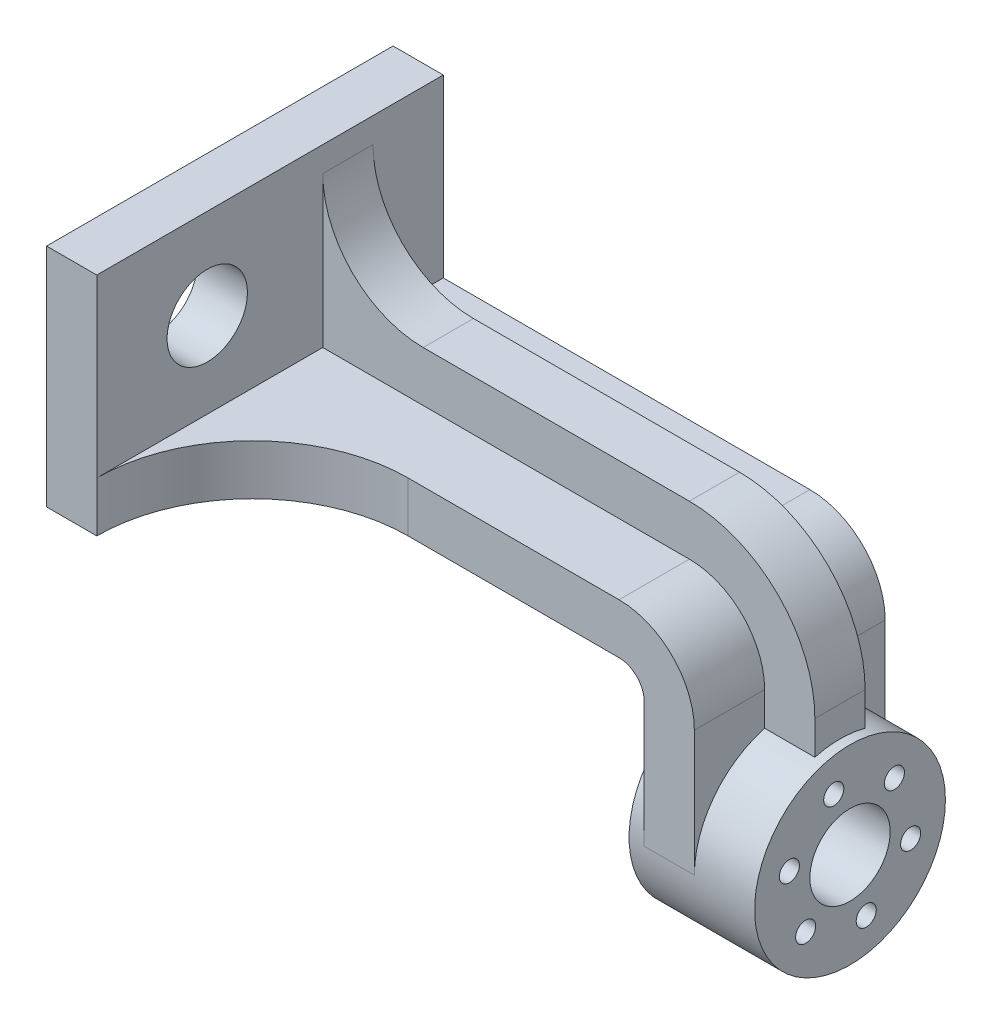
ISO-10303-21;
HEADER;
FILE_DESCRIPTION(('STEP AP214'),'2;1');
FILE_NAME('part.step','',(''),(''),'','','');
FILE_SCHEMA(('AUTOMOTIVE_DESIGN { 1 0 10303 214 1 1 1 1 }'));
ENDSEC;
DATA;
#1=APPLICATION_CONTEXT('core data for automotive mechanical design processes');
#2=APPLICATION_PROTOCOL_DEFINITION('international standard','automotive_design',2000,#1);
#3=PRODUCT_CONTEXT('',#1,'mechanical');
#4=PRODUCT('Part','Part','',(#3));
#5=PRODUCT_RELATED_PRODUCT_CATEGORY('part','',(#4));
#6=PRODUCT_DEFINITION_FORMATION('','',#4);
#7=PRODUCT_DEFINITION_CONTEXT('part definition',#1,'design');
#8=PRODUCT_DEFINITION('design','',#6,#7);
#9=PRODUCT_DEFINITION_SHAPE('','',#8);
#10=(LENGTH_UNIT() NAMED_UNIT(*) SI_UNIT(.MILLI.,.METRE.));
#11=(NAMED_UNIT(*) PLANE_ANGLE_UNIT() SI_UNIT($,.RADIAN.));
#12=(NAMED_UNIT(*) SI_UNIT($,.STERADIAN.) SOLID_ANGLE_UNIT());
#13=UNCERTAINTY_MEASURE_WITH_UNIT(LENGTH_MEASURE(1.E-05),#10,'distance_accuracy_value','');
#14=(GEOMETRIC_REPRESENTATION_CONTEXT(3) GLOBAL_UNCERTAINTY_ASSIGNED_CONTEXT((#13)) GLOBAL_UNIT_ASSIGNED_CONTEXT((#10,
#11,#12)) REPRESENTATION_CONTEXT('',''));
#15=CARTESIAN_POINT('',(0.,0.,0.));
#16=DIRECTION('',(0.,0.,1.));
#17=DIRECTION('',(1.,0.,0.));
#18=AXIS2_PLACEMENT_3D('',#15,#16,#17);
#19=CARTESIAN_POINT('',(98.,10.,3.5));
#20=DIRECTION('',(1.,0.,0.));
#21=DIRECTION('',(0.,0.,-1.));
#22=AXIS2_PLACEMENT_3D('',#19,#20,#21);
#23=PLANE('',#22);
#24=CARTESIAN_POINT('',(98.,-30.,-15.5));
#25=DIRECTION('',(1.,0.,0.));
#26=DIRECTION('',(0.,0.,-1.));
#27=AXIS2_PLACEMENT_3D('',#24,#25,#26);
#28=CIRCLE('',#27,19.);
#29=CARTESIAN_POINT('',(98.,-11.6696972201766,-10.5));
#30=VERTEX_POINT('',#29);
#31=CARTESIAN_POINT('',(98.,-30.,3.5));
#32=VERTEX_POINT('',#31);
#33=EDGE_CURVE('E284',#30,#32,#28,.T.);
#34=ORIENTED_EDGE('',*,*,#33,.F.);
#35=DIRECTION('',(0.,1.,0.));
#36=VECTOR('',#35,1.);
#37=CARTESIAN_POINT('',(98.,10.,-10.5));
#38=LINE('',#37,#36);
#39=CARTESIAN_POINT('',(98.,-5.,-10.5));
#40=VERTEX_POINT('',#39);
#41=EDGE_CURVE('E217',#30,#40,#38,.T.);
#42=ORIENTED_EDGE('',*,*,#41,.T.);
#43=DIRECTION('',(0.,0.,-1.));
#44=VECTOR('',#43,1.);
#45=CARTESIAN_POINT('',(98.,-5.,3.5));
#46=LINE('',#45,#44);
#47=CARTESIAN_POINT('',(98.,-5.,3.5));
#48=VERTEX_POINT('',#47);
#49=EDGE_CURVE('E352',#40,#48,#46,.F.);
#50=ORIENTED_EDGE('',*,*,#49,.T.);
#51=DIRECTION('',(0.,-1.,0.));
#52=VECTOR('',#51,1.);
#53=CARTESIAN_POINT('',(98.,10.,3.5));
#54=LINE('',#53,#52);
#55=EDGE_CURVE('E294',#48,#32,#54,.T.);
#56=ORIENTED_EDGE('',*,*,#55,.T.);
#57=EDGE_LOOP('',(#34,#42,#50,#56));
#58=FACE_BOUND('',#57,.T.);
#59=ADVANCED_FACE('F35',(#58),#23,.T.);
#60=CARTESIAN_POINT('',(10.,10.,3.5));
#61=DIRECTION('',(0.,1.,0.));
#62=DIRECTION('',(-1.,0.,0.));
#63=AXIS2_PLACEMENT_3D('',#60,#61,#62);
#64=PLANE('',#63);
#65=DIRECTION('',(0.,0.,-1.));
#66=VECTOR('',#65,1.);
#67=CARTESIAN_POINT('',(83.,10.,3.5));
#68=LINE('',#67,#66);
#69=CARTESIAN_POINT('',(83.,10.,3.5));
#70=VERTEX_POINT('',#69);
#71=CARTESIAN_POINT('',(83.,10.,-10.5));
#72=VERTEX_POINT('',#71);
#73=EDGE_CURVE('E355',#70,#72,#68,.T.);
#74=ORIENTED_EDGE('',*,*,#73,.T.);
#75=DIRECTION('',(-1.,0.,0.));
#76=VECTOR('',#75,1.);
#77=CARTESIAN_POINT('',(10.,10.,-10.5));
#78=LINE('',#77,#76);
#79=CARTESIAN_POINT('',(10.,10.,-10.5));
#80=VERTEX_POINT('',#79);
#81=EDGE_CURVE('E214',#72,#80,#78,.T.);
#82=ORIENTED_EDGE('',*,*,#81,.T.);
#83=DIRECTION('',(0.,0.,-1.));
#84=VECTOR('',#83,1.);
#85=CARTESIAN_POINT('',(10.,10.,3.5));
#86=LINE('',#85,#84);
#87=CARTESIAN_POINT('',(10.,10.,34.5));
#88=VERTEX_POINT('',#87);
#89=EDGE_CURVE('E318',#88,#80,#86,.T.);
#90=ORIENTED_EDGE('',*,*,#89,.F.);
#91=CARTESIAN_POINT('',(41.,10.,34.5));
#92=DIRECTION('',(0.,1.,0.));
#93=DIRECTION('',(-1.,0.,0.));
#94=AXIS2_PLACEMENT_3D('',#91,#92,#93);
#95=CIRCLE('',#94,31.);
#96=CARTESIAN_POINT('',(41.,10.,3.5));
#97=VERTEX_POINT('',#96);
#98=EDGE_CURVE('E341',#88,#97,#95,.F.);
#99=ORIENTED_EDGE('',*,*,#98,.T.);
#100=DIRECTION('',(1.,0.,0.));
#101=VECTOR('',#100,1.);
#102=CARTESIAN_POINT('',(10.,10.,3.5));
#103=LINE('',#102,#101);
#104=EDGE_CURVE('E291',#97,#70,#103,.T.);
#105=ORIENTED_EDGE('',*,*,#104,.T.);
#106=EDGE_LOOP('',(#74,#82,#90,#99,#105));
#107=FACE_BOUND('',#106,.T.);
#108=ADVANCED_FACE('F392',(#107),#64,.T.);
#109=CARTESIAN_POINT('',(83.,-5.,3.5));
#110=DIRECTION('',(0.,0.,-1.));
#111=DIRECTION('',(-1.,0.,0.));
#112=AXIS2_PLACEMENT_3D('',#109,#110,#111);
#113=CYLINDRICAL_SURFACE('',#112,15.);
#114=ORIENTED_EDGE('',*,*,#49,.F.);
#115=CARTESIAN_POINT('',(83.,-5.,-10.5));
#116=DIRECTION('',(0.,0.,-1.));
#117=DIRECTION('',(-1.,0.,0.));
#118=AXIS2_PLACEMENT_3D('',#115,#116,#117);
#119=CIRCLE('',#118,15.);
#120=EDGE_CURVE('E206',#40,#72,#119,.F.);
#121=ORIENTED_EDGE('',*,*,#120,.T.);
#122=ORIENTED_EDGE('',*,*,#73,.F.);
#123=CARTESIAN_POINT('',(83.,-5.,3.5));
#124=DIRECTION('',(0.,0.,-1.));
#125=DIRECTION('',(-1.,0.,0.));
#126=AXIS2_PLACEMENT_3D('',#123,#124,#125);
#127=CIRCLE('',#126,15.);
#128=EDGE_CURVE('E361',#48,#70,#127,.F.);
#129=ORIENTED_EDGE('',*,*,#128,.F.);
#130=EDGE_LOOP('',(#114,#121,#122,#129));
#131=FACE_BOUND('',#130,.T.);
#132=ADVANCED_FACE('F398',(#131),#113,.T.);
#133=CARTESIAN_POINT('',(10.,0.,-34.5));
#134=DIRECTION('',(0.,0.,1.));
#135=DIRECTION('',(1.,0.,0.));
#136=AXIS2_PLACEMENT_3D('',#133,#134,#135);
#137=PLANE('',#136);
#138=DIRECTION('',(1.,0.,0.));
#139=VECTOR('',#138,1.);
#140=CARTESIAN_POINT('',(10.,10.,-34.5));
#141=LINE('',#140,#139);
#142=CARTESIAN_POINT('',(10.,10.,-34.5));
#143=VERTEX_POINT('',#142);
#144=CARTESIAN_POINT('',(83.,10.,-34.5));
#145=VERTEX_POINT('',#144);
#146=EDGE_CURVE('E290',#143,#145,#141,.T.);
#147=ORIENTED_EDGE('',*,*,#146,.T.);
#148=CARTESIAN_POINT('',(83.,-5.,-34.5));
#149=DIRECTION('',(0.,0.,1.));
#150=DIRECTION('',(1.,0.,0.));
#151=AXIS2_PLACEMENT_3D('',#148,#149,#150);
#152=CIRCLE('',#151,15.);
#153=CARTESIAN_POINT('',(98.,-5.,-34.5));
#154=VERTEX_POINT('',#153);
#155=EDGE_CURVE('E353',#145,#154,#152,.F.);
#156=ORIENTED_EDGE('',*,*,#155,.T.);
#157=DIRECTION('',(0.,-1.,0.));
#158=VECTOR('',#157,1.);
#159=CARTESIAN_POINT('',(98.,10.,-34.5));
#160=LINE('',#159,#158);
#161=CARTESIAN_POINT('',(98.,-30.,-34.5));
#162=VERTEX_POINT('',#161);
#163=EDGE_CURVE('E305',#154,#162,#160,.T.);
#164=ORIENTED_EDGE('',*,*,#163,.T.);
#165=DIRECTION('',(-1.,0.,0.));
#166=VECTOR('',#165,1.);
#167=CARTESIAN_POINT('',(98.,-30.,-34.5));
#168=LINE('',#167,#166);
#169=CARTESIAN_POINT('',(88.,-30.,-34.5));
#170=VERTEX_POINT('',#169);
#171=EDGE_CURVE('E307',#162,#170,#168,.T.);
#172=ORIENTED_EDGE('',*,*,#171,.T.);
#173=DIRECTION('',(0.,1.,0.));
#174=VECTOR('',#173,1.);
#175=CARTESIAN_POINT('',(88.,-30.,-34.5));
#176=LINE('',#175,#174);
#177=CARTESIAN_POINT('',(88.,-4.99999999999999,-34.5));
#178=VERTEX_POINT('',#177);
#179=EDGE_CURVE('E295',#170,#178,#176,.T.);
#180=ORIENTED_EDGE('',*,*,#179,.T.);
#181=CARTESIAN_POINT('',(83.,-4.99999999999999,-34.5));
#182=DIRECTION('',(0.,0.,1.));
#183=DIRECTION('',(1.,0.,0.));
#184=AXIS2_PLACEMENT_3D('',#181,#182,#183);
#185=CIRCLE('',#184,5.);
#186=CARTESIAN_POINT('',(83.,0.,-34.5));
#187=VERTEX_POINT('',#186);
#188=EDGE_CURVE('E332',#178,#187,#185,.T.);
#189=ORIENTED_EDGE('',*,*,#188,.T.);
#190=DIRECTION('',(-1.,0.,0.));
#191=VECTOR('',#190,1.);
#192=CARTESIAN_POINT('',(10.,0.,-34.5));
#193=LINE('',#192,#191);
#194=CARTESIAN_POINT('',(0.,0.,-34.5));
#195=VERTEX_POINT('',#194);
#196=EDGE_CURVE('E518',#187,#195,#193,.T.);
#197=ORIENTED_EDGE('',*,*,#196,.T.);
#198=DIRECTION('',(0.,1.,0.));
#199=VECTOR('',#198,1.);
#200=CARTESIAN_POINT('',(0.,0.,-34.5));
#201=LINE('',#200,#199);
#202=CARTESIAN_POINT('',(0.,45.,-34.5));
#203=VERTEX_POINT('',#202);
#204=EDGE_CURVE('E533',#195,#203,#201,.T.);
#205=ORIENTED_EDGE('',*,*,#204,.T.);
#206=DIRECTION('',(-1.,0.,0.));
#207=VECTOR('',#206,1.);
#208=CARTESIAN_POINT('',(10.,45.,-34.5));
#209=LINE('',#208,#207);
#210=CARTESIAN_POINT('',(10.,45.,-34.5));
#211=VERTEX_POINT('',#210);
#212=EDGE_CURVE('E363',#211,#203,#209,.T.);
#213=ORIENTED_EDGE('',*,*,#212,.F.);
#214=DIRECTION('',(0.,1.,0.));
#215=VECTOR('',#214,1.);
#216=CARTESIAN_POINT('',(10.,0.,-34.5));
#217=LINE('',#216,#215);
#218=EDGE_CURVE('E431',#143,#211,#217,.T.);
#219=ORIENTED_EDGE('',*,*,#218,.F.);
#220=EDGE_LOOP('',(#147,#156,#164,#172,#180,#189,#197,#205,#213,#219));
#221=FACE_BOUND('',#220,.T.);
#222=ADVANCED_FACE('F422',(#221),#137,.F.);
#223=CARTESIAN_POINT('',(10.,45.,34.5));
#224=DIRECTION('',(0.,-1.,0.));
#225=DIRECTION('',(0.,0.,-1.));
#226=AXIS2_PLACEMENT_3D('',#223,#224,#225);
#227=PLANE('',#226);
#228=DIRECTION('',(0.,0.,1.));
#229=VECTOR('',#228,1.);
#230=CARTESIAN_POINT('',(0.,45.,34.5));
#231=LINE('',#230,#229);
#232=CARTESIAN_POINT('',(0.,45.,34.5));
#233=VERTEX_POINT('',#232);
#234=EDGE_CURVE('E537',#203,#233,#231,.T.);
#235=ORIENTED_EDGE('',*,*,#234,.T.);
#236=DIRECTION('',(-1.,0.,0.));
#237=VECTOR('',#236,1.);
#238=CARTESIAN_POINT('',(10.,45.,34.5));
#239=LINE('',#238,#237);
#240=CARTESIAN_POINT('',(10.,45.,34.5));
#241=VERTEX_POINT('',#240);
#242=EDGE_CURVE('E517',#241,#233,#239,.T.);
#243=ORIENTED_EDGE('',*,*,#242,.F.);
#244=DIRECTION('',(0.,0.,1.));
#245=VECTOR('',#244,1.);
#246=CARTESIAN_POINT('',(10.,45.,34.5));
#247=LINE('',#246,#245);
#248=EDGE_CURVE('E528',#211,#241,#247,.T.);
#249=ORIENTED_EDGE('',*,*,#248,.F.);
#250=ORIENTED_EDGE('',*,*,#212,.T.);
#251=EDGE_LOOP('',(#235,#243,#249,#250));
#252=FACE_BOUND('',#251,.T.);
#253=ADVANCED_FACE('F535',(#252),#227,.F.);
#254=CARTESIAN_POINT('',(10.,0.,34.5));
#255=DIRECTION('',(0.,0.,-1.));
#256=DIRECTION('',(0.,1.,0.));
#257=AXIS2_PLACEMENT_3D('',#254,#255,#256);
#258=PLANE('',#257);
#259=DIRECTION('',(0.,-1.,0.));
#260=VECTOR('',#259,1.);
#261=CARTESIAN_POINT('',(0.,0.,34.5));
#262=LINE('',#261,#260);
#263=CARTESIAN_POINT('',(0.,0.,34.5));
#264=VERTEX_POINT('',#263);
#265=EDGE_CURVE('E516',#233,#264,#262,.T.);
#266=ORIENTED_EDGE('',*,*,#265,.T.);
#267=DIRECTION('',(-1.,0.,0.));
#268=VECTOR('',#267,1.);
#269=CARTESIAN_POINT('',(10.,0.,34.5));
#270=LINE('',#269,#268);
#271=CARTESIAN_POINT('',(10.,0.,34.5));
#272=VERTEX_POINT('',#271);
#273=EDGE_CURVE('E508',#272,#264,#270,.T.);
#274=ORIENTED_EDGE('',*,*,#273,.F.);
#275=DIRECTION('',(0.,-1.,0.));
#276=VECTOR('',#275,1.);
#277=CARTESIAN_POINT('',(10.,0.,34.5));
#278=LINE('',#277,#276);
#279=EDGE_CURVE('E504',#88,#272,#278,.T.);
#280=ORIENTED_EDGE('',*,*,#279,.F.);
#281=EDGE_CURVE('E521',#241,#88,#278,.T.);
#282=ORIENTED_EDGE('',*,*,#281,.F.);
#283=ORIENTED_EDGE('',*,*,#242,.T.);
#284=EDGE_LOOP('',(#266,#274,#280,#282,#283));
#285=FACE_BOUND('',#284,.T.);
#286=ADVANCED_FACE('F511',(#285),#258,.F.);
#287=CARTESIAN_POINT('',(10.,0.,34.5));
#288=DIRECTION('',(0.,1.,0.));
#289=DIRECTION('',(0.,0.,1.));
#290=AXIS2_PLACEMENT_3D('',#287,#288,#289);
#291=PLANE('',#290);
#292=DIRECTION('',(0.,0.,-1.));
#293=VECTOR('',#292,1.);
#294=CARTESIAN_POINT('',(83.,0.,34.5));
#295=LINE('',#294,#293);
#296=CARTESIAN_POINT('',(83.,0.,3.5));
#297=VERTEX_POINT('',#296);
#298=EDGE_CURVE('E345',#187,#297,#295,.F.);
#299=ORIENTED_EDGE('',*,*,#298,.T.);
#300=DIRECTION('',(-1.,0.,0.));
#301=VECTOR('',#300,1.);
#302=CARTESIAN_POINT('',(88.,0.,3.5));
#303=LINE('',#302,#301);
#304=CARTESIAN_POINT('',(41.,0.,3.5));
#305=VERTEX_POINT('',#304);
#306=EDGE_CURVE('E304',#297,#305,#303,.T.);
#307=ORIENTED_EDGE('',*,*,#306,.T.);
#308=CARTESIAN_POINT('',(41.,0.,34.5));
#309=DIRECTION('',(0.,1.,0.));
#310=DIRECTION('',(0.,0.,1.));
#311=AXIS2_PLACEMENT_3D('',#308,#309,#310);
#312=CIRCLE('',#311,31.);
#313=EDGE_CURVE('E336',#305,#272,#312,.T.);
#314=ORIENTED_EDGE('',*,*,#313,.T.);
#315=ORIENTED_EDGE('',*,*,#273,.T.);
#316=DIRECTION('',(0.,0.,-1.));
#317=VECTOR('',#316,1.);
#318=CARTESIAN_POINT('',(0.,0.,34.5));
#319=LINE('',#318,#317);
#320=EDGE_CURVE('E529',#264,#195,#319,.T.);
#321=ORIENTED_EDGE('',*,*,#320,.T.);
#322=ORIENTED_EDGE('',*,*,#196,.F.);
#323=EDGE_LOOP('',(#299,#307,#314,#315,#321,#322));
#324=FACE_BOUND('',#323,.T.);
#325=ADVANCED_FACE('F386',(#324),#291,.F.);
#326=CARTESIAN_POINT('',(10.,45.,-34.5));
#327=DIRECTION('',(-1.,0.,0.));
#328=DIRECTION('',(0.,0.,1.));
#329=AXIS2_PLACEMENT_3D('',#326,#327,#328);
#330=PLANE('',#329);
#331=CARTESIAN_POINT('',(10.,27.,12.5));
#332=DIRECTION('',(1.,0.,0.));
#333=DIRECTION('',(0.,0.,-1.));
#334=AXIS2_PLACEMENT_3D('',#331,#332,#333);
#335=CIRCLE('',#334,8.);
#336=CARTESIAN_POINT('',(10.,27.,4.50000000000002));
#337=VERTEX_POINT('',#336);
#338=EDGE_CURVE('E232',#337,#337,#335,.T.);
#339=ORIENTED_EDGE('',*,*,#338,.F.);
#340=EDGE_LOOP('',(#339));
#341=FACE_BOUND('',#340,.T.);
#342=DIRECTION('',(0.,0.,-1.));
#343=VECTOR('',#342,1.);
#344=CARTESIAN_POINT('',(10.,40.,-34.5));
#345=LINE('',#344,#343);
#346=CARTESIAN_POINT('',(10.,40.,-10.5));
#347=VERTEX_POINT('',#346);
#348=CARTESIAN_POINT('',(10.,40.,-20.5));
#349=VERTEX_POINT('',#348);
#350=EDGE_CURVE('E327',#347,#349,#345,.T.);
#351=ORIENTED_EDGE('',*,*,#350,.T.);
#352=DIRECTION('',(0.,-1.,0.));
#353=VECTOR('',#352,1.);
#354=CARTESIAN_POINT('',(10.,45.,-20.5));
#355=LINE('',#354,#353);
#356=CARTESIAN_POINT('',(10.,10.,-20.5));
#357=VERTEX_POINT('',#356);
#358=EDGE_CURVE('E223',#349,#357,#355,.T.);
#359=ORIENTED_EDGE('',*,*,#358,.T.);
#360=EDGE_CURVE('E322',#357,#143,#86,.T.);
#361=ORIENTED_EDGE('',*,*,#360,.T.);
#362=ORIENTED_EDGE('',*,*,#218,.T.);
#363=ORIENTED_EDGE('',*,*,#248,.T.);
#364=ORIENTED_EDGE('',*,*,#281,.T.);
#365=ORIENTED_EDGE('',*,*,#89,.T.);
#366=DIRECTION('',(0.,-1.,0.));
#367=VECTOR('',#366,1.);
#368=CARTESIAN_POINT('',(10.,45.,-10.5));
#369=LINE('',#368,#367);
#370=EDGE_CURVE('E211',#347,#80,#369,.T.);
#371=ORIENTED_EDGE('',*,*,#370,.F.);
#372=EDGE_LOOP('',(#351,#359,#361,#362,#363,#364,#365,#371));
#373=FACE_BOUND('',#372,.T.);
#374=ADVANCED_FACE('F376',(#341,#373),#330,.F.);
#375=CARTESIAN_POINT('',(0.,45.,-34.5));
#376=DIRECTION('',(-1.,0.,0.));
#377=DIRECTION('',(0.,0.,1.));
#378=AXIS2_PLACEMENT_3D('',#375,#376,#377);
#379=PLANE('',#378);
#380=ORIENTED_EDGE('',*,*,#204,.F.);
#381=ORIENTED_EDGE('',*,*,#320,.F.);
#382=ORIENTED_EDGE('',*,*,#265,.F.);
#383=ORIENTED_EDGE('',*,*,#234,.F.);
#384=EDGE_LOOP('',(#380,#381,#382,#383));
#385=FACE_BOUND('',#384,.T.);
#386=CARTESIAN_POINT('',(0.,27.,12.5));
#387=DIRECTION('',(-1.,0.,0.));
#388=DIRECTION('',(0.,0.,1.));
#389=AXIS2_PLACEMENT_3D('',#386,#387,#388);
#390=CIRCLE('',#389,8.);
#391=CARTESIAN_POINT('',(0.,27.,20.5));
#392=VERTEX_POINT('',#391);
#393=EDGE_CURVE('E235',#392,#392,#390,.T.);
#394=ORIENTED_EDGE('',*,*,#393,.F.);
#395=EDGE_LOOP('',(#394));
#396=FACE_BOUND('',#395,.T.);
#397=ADVANCED_FACE('F373',(#385,#396),#379,.T.);
#398=CARTESIAN_POINT('',(88.,-30.,3.5));
#399=DIRECTION('',(-1.,0.,0.));
#400=DIRECTION('',(0.,0.,1.));
#401=AXIS2_PLACEMENT_3D('',#398,#399,#400);
#402=PLANE('',#401);
#403=ORIENTED_EDGE('',*,*,#179,.F.);
#404=CARTESIAN_POINT('',(88.,-30.,-15.5));
#405=DIRECTION('',(-1.,0.,0.));
#406=DIRECTION('',(0.,0.,1.));
#407=AXIS2_PLACEMENT_3D('',#404,#405,#406);
#408=CIRCLE('',#407,19.);
#409=CARTESIAN_POINT('',(88.,-30.,3.5));
#410=VERTEX_POINT('',#409);
#411=EDGE_CURVE('E288',#410,#170,#408,.T.);
#412=ORIENTED_EDGE('',*,*,#411,.F.);
#413=DIRECTION('',(0.,1.,0.));
#414=VECTOR('',#413,1.);
#415=CARTESIAN_POINT('',(88.,-30.,3.5));
#416=LINE('',#415,#414);
#417=CARTESIAN_POINT('',(88.,-4.99999999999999,3.5));
#418=VERTEX_POINT('',#417);
#419=EDGE_CURVE('E301',#410,#418,#416,.T.);
#420=ORIENTED_EDGE('',*,*,#419,.T.);
#421=DIRECTION('',(0.,0.,-1.));
#422=VECTOR('',#421,1.);
#423=CARTESIAN_POINT('',(88.,-4.99999999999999,3.5));
#424=LINE('',#423,#422);
#425=EDGE_CURVE('E347',#418,#178,#424,.T.);
#426=ORIENTED_EDGE('',*,*,#425,.T.);
#427=EDGE_LOOP('',(#403,#412,#420,#426));
#428=FACE_BOUND('',#427,.T.);
#429=ADVANCED_FACE('F375',(#428),#402,.T.);
#430=DIRECTION('',(0.,1.,0.));
#431=VECTOR('',#430,1.);
#432=CARTESIAN_POINT('',(98.,10.,-20.5));
#433=LINE('',#432,#431);
#434=CARTESIAN_POINT('',(98.,-11.6696972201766,-20.5));
#435=VERTEX_POINT('',#434);
#436=CARTESIAN_POINT('',(98.,-5.,-20.5));
#437=VERTEX_POINT('',#436);
#438=EDGE_CURVE('E227',#435,#437,#433,.T.);
#439=ORIENTED_EDGE('',*,*,#438,.F.);
#440=EDGE_CURVE('E285',#162,#435,#28,.T.);
#441=ORIENTED_EDGE('',*,*,#440,.F.);
#442=ORIENTED_EDGE('',*,*,#163,.F.);
#443=EDGE_CURVE('E349',#154,#437,#46,.F.);
#444=ORIENTED_EDGE('',*,*,#443,.T.);
#445=EDGE_LOOP('',(#439,#441,#442,#444));
#446=FACE_BOUND('',#445,.T.);
#447=ADVANCED_FACE('F383',(#446),#23,.T.);
#448=DIRECTION('',(-1.,0.,0.));
#449=VECTOR('',#448,1.);
#450=CARTESIAN_POINT('',(10.,10.,-20.5));
#451=LINE('',#450,#449);
#452=CARTESIAN_POINT('',(83.,10.,-20.5));
#453=VERTEX_POINT('',#452);
#454=EDGE_CURVE('E225',#453,#357,#451,.T.);
#455=ORIENTED_EDGE('',*,*,#454,.F.);
#456=EDGE_CURVE('E358',#453,#145,#68,.T.);
#457=ORIENTED_EDGE('',*,*,#456,.T.);
#458=ORIENTED_EDGE('',*,*,#146,.F.);
#459=ORIENTED_EDGE('',*,*,#360,.F.);
#460=EDGE_LOOP('',(#455,#457,#458,#459));
#461=FACE_BOUND('',#460,.T.);
#462=ADVANCED_FACE('F401',(#461),#64,.T.);
#463=CARTESIAN_POINT('',(10.,10.,3.5));
#464=DIRECTION('',(0.,0.,-1.));
#465=DIRECTION('',(-1.,0.,0.));
#466=AXIS2_PLACEMENT_3D('',#463,#464,#465);
#467=PLANE('',#466);
#468=ORIENTED_EDGE('',*,*,#104,.F.);
#469=DIRECTION('',(0.,1.,0.));
#470=VECTOR('',#469,1.);
#471=CARTESIAN_POINT('',(41.,0.,3.5));
#472=LINE('',#471,#470);
#473=EDGE_CURVE('E359',#97,#305,#472,.F.);
#474=ORIENTED_EDGE('',*,*,#473,.T.);
#475=ORIENTED_EDGE('',*,*,#306,.F.);
#476=CARTESIAN_POINT('',(83.,-4.99999999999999,3.5));
#477=DIRECTION('',(0.,0.,-1.));
#478=DIRECTION('',(-1.,0.,0.));
#479=AXIS2_PLACEMENT_3D('',#476,#477,#478);
#480=CIRCLE('',#479,5.);
#481=EDGE_CURVE('E325',#297,#418,#480,.T.);
#482=ORIENTED_EDGE('',*,*,#481,.T.);
#483=ORIENTED_EDGE('',*,*,#419,.F.);
#484=DIRECTION('',(-1.,0.,0.));
#485=VECTOR('',#484,1.);
#486=CARTESIAN_POINT('',(98.,-30.,3.5));
#487=LINE('',#486,#485);
#488=EDGE_CURVE('E298',#32,#410,#487,.T.);
#489=ORIENTED_EDGE('',*,*,#488,.F.);
#490=ORIENTED_EDGE('',*,*,#55,.F.);
#491=ORIENTED_EDGE('',*,*,#128,.T.);
#492=EDGE_LOOP('',(#468,#474,#475,#482,#483,#489,#490,#491));
#493=FACE_BOUND('',#492,.T.);
#494=ADVANCED_FACE('F408',(#493),#467,.F.);
#495=CARTESIAN_POINT('',(85.,-30.,-15.5));
#496=DIRECTION('',(1.,0.,0.));
#497=DIRECTION('',(0.,0.,-1.));
#498=AXIS2_PLACEMENT_3D('',#495,#496,#497);
#499=CYLINDRICAL_SURFACE('',#498,19.);
#500=CARTESIAN_POINT('',(85.,-30.,-15.5));
#501=DIRECTION('',(1.,0.,0.));
#502=DIRECTION('',(0.,0.,-1.));
#503=AXIS2_PLACEMENT_3D('',#500,#501,#502);
#504=CIRCLE('',#503,19.);
#505=CARTESIAN_POINT('',(85.,-30.,-34.5));
#506=VERTEX_POINT('',#505);
#507=EDGE_CURVE('E281',#506,#506,#504,.T.);
#508=ORIENTED_EDGE('',*,*,#507,.T.);
#509=EDGE_LOOP('',(#508));
#510=FACE_BOUND('',#509,.T.);
#511=ORIENTED_EDGE('',*,*,#411,.T.);
#512=ORIENTED_EDGE('',*,*,#171,.F.);
#513=ORIENTED_EDGE('',*,*,#440,.T.);
#514=DIRECTION('',(1.,0.,0.));
#515=VECTOR('',#514,1.);
#516=CARTESIAN_POINT('',(85.,-11.6696972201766,-20.5));
#517=LINE('',#516,#515);
#518=CARTESIAN_POINT('',(108.,-11.6696972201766,-20.5));
#519=VERTEX_POINT('',#518);
#520=EDGE_CURVE('E221',#519,#435,#517,.F.);
#521=ORIENTED_EDGE('',*,*,#520,.F.);
#522=CARTESIAN_POINT('',(108.,-30.,-15.5));
#523=DIRECTION('',(1.,0.,0.));
#524=DIRECTION('',(0.,0.,-1.));
#525=AXIS2_PLACEMENT_3D('',#522,#523,#524);
#526=CIRCLE('',#525,19.);
#527=CARTESIAN_POINT('',(108.,-11.6696972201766,-10.5));
#528=VERTEX_POINT('',#527);
#529=EDGE_CURVE('E196',#528,#519,#526,.F.);
#530=ORIENTED_EDGE('',*,*,#529,.F.);
#531=DIRECTION('',(1.,0.,0.));
#532=VECTOR('',#531,1.);
#533=CARTESIAN_POINT('',(85.,-11.6696972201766,-10.5));
#534=LINE('',#533,#532);
#535=EDGE_CURVE('E207',#528,#30,#534,.F.);
#536=ORIENTED_EDGE('',*,*,#535,.T.);
#537=ORIENTED_EDGE('',*,*,#33,.T.);
#538=ORIENTED_EDGE('',*,*,#488,.T.);
#539=EDGE_LOOP('',(#511,#512,#513,#521,#530,#536,#537,#538));
#540=FACE_BOUND('',#539,.T.);
#541=CARTESIAN_POINT('',(110.,-30.,-15.5));
#542=DIRECTION('',(1.,0.,0.));
#543=DIRECTION('',(0.,0.,-1.));
#544=AXIS2_PLACEMENT_3D('',#541,#542,#543);
#545=CIRCLE('',#544,19.);
#546=CARTESIAN_POINT('',(110.,-30.,-34.5));
#547=VERTEX_POINT('',#546);
#548=EDGE_CURVE('E278',#547,#547,#545,.T.);
#549=ORIENTED_EDGE('',*,*,#548,.F.);
#550=EDGE_LOOP('',(#549));
#551=FACE_BOUND('',#550,.T.);
#552=ADVANCED_FACE('F417',(#510,#540,#551),#499,.T.);
#553=CARTESIAN_POINT('',(85.,-30.,-15.5));
#554=DIRECTION('',(1.,0.,0.));
#555=DIRECTION('',(0.,0.,-1.));
#556=AXIS2_PLACEMENT_3D('',#553,#554,#555);
#557=PLANE('',#556);
#558=CARTESIAN_POINT('',(85.,-42.0740728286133,-18.7352380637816));
#559=DIRECTION('',(1.,0.,0.));
#560=DIRECTION('',(0.,0.,-1.));
#561=AXIS2_PLACEMENT_3D('',#558,#559,#560);
#562=CIRCLE('',#561,2.);
#563=CARTESIAN_POINT('',(85.,-42.0740728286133,-20.7352380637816));
#564=VERTEX_POINT('',#563);
#565=EDGE_CURVE('E245',#564,#564,#562,.F.);
#566=ORIENTED_EDGE('',*,*,#565,.F.);
#567=EDGE_LOOP('',(#566));
#568=FACE_BOUND('',#567,.T.);
#569=CARTESIAN_POINT('',(85.,-30.,-15.5));
#570=DIRECTION('',(1.,0.,0.));
#571=DIRECTION('',(0.,0.,-1.));
#572=AXIS2_PLACEMENT_3D('',#569,#570,#571);
#573=CIRCLE('',#572,8.);
#574=CARTESIAN_POINT('',(85.,-30.,-23.5));
#575=VERTEX_POINT('',#574);
#576=EDGE_CURVE('E275',#575,#575,#573,.F.);
#577=ORIENTED_EDGE('',*,*,#576,.F.);
#578=EDGE_LOOP('',(#577));
#579=FACE_BOUND('',#578,.T.);
#580=CARTESIAN_POINT('',(85.,-33.2352380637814,-27.5740728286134));
#581=DIRECTION('',(1.,0.,0.));
#582=DIRECTION('',(0.,0.,-1.));
#583=AXIS2_PLACEMENT_3D('',#580,#581,#582);
#584=CIRCLE('',#583,2.);
#585=CARTESIAN_POINT('',(85.,-33.2352380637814,-29.5740728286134));
#586=VERTEX_POINT('',#585);
#587=EDGE_CURVE('E239',#586,#586,#584,.F.);
#588=ORIENTED_EDGE('',*,*,#587,.F.);
#589=EDGE_LOOP('',(#588));
#590=FACE_BOUND('',#589,.T.);
#591=ORIENTED_EDGE('',*,*,#507,.F.);
#592=EDGE_LOOP('',(#591));
#593=FACE_BOUND('',#592,.T.);
#594=CARTESIAN_POINT('',(85.,-21.1611652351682,-24.3388347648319));
#595=DIRECTION('',(1.,0.,0.));
#596=DIRECTION('',(0.,0.,-1.));
#597=AXIS2_PLACEMENT_3D('',#594,#595,#596);
#598=CIRCLE('',#597,2.);
#599=CARTESIAN_POINT('',(85.,-21.1611652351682,-26.3388347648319));
#600=VERTEX_POINT('',#599);
#601=EDGE_CURVE('E269',#600,#600,#598,.F.);
#602=ORIENTED_EDGE('',*,*,#601,.F.);
#603=EDGE_LOOP('',(#602));
#604=FACE_BOUND('',#603,.T.);
#605=CARTESIAN_POINT('',(85.,-17.9259271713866,-12.2647619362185));
#606=DIRECTION('',(1.,0.,0.));
#607=DIRECTION('',(0.,0.,-1.));
#608=AXIS2_PLACEMENT_3D('',#605,#606,#607);
#609=CIRCLE('',#608,2.);
#610=CARTESIAN_POINT('',(85.,-17.9259271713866,-14.2647619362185));
#611=VERTEX_POINT('',#610);
#612=EDGE_CURVE('E263',#611,#611,#609,.F.);
#613=ORIENTED_EDGE('',*,*,#612,.F.);
#614=EDGE_LOOP('',(#613));
#615=FACE_BOUND('',#614,.T.);
#616=CARTESIAN_POINT('',(85.,-26.7647619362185,-3.42592717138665));
#617=DIRECTION('',(1.,0.,0.));
#618=DIRECTION('',(0.,0.,-1.));
#619=AXIS2_PLACEMENT_3D('',#616,#617,#618);
#620=CIRCLE('',#619,2.);
#621=CARTESIAN_POINT('',(85.,-26.7647619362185,-5.42592717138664));
#622=VERTEX_POINT('',#621);
#623=EDGE_CURVE('E257',#622,#622,#620,.F.);
#624=ORIENTED_EDGE('',*,*,#623,.F.);
#625=EDGE_LOOP('',(#624));
#626=FACE_BOUND('',#625,.T.);
#627=CARTESIAN_POINT('',(85.,-38.8388347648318,-6.66116523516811));
#628=DIRECTION('',(1.,0.,0.));
#629=DIRECTION('',(0.,0.,-1.));
#630=AXIS2_PLACEMENT_3D('',#627,#628,#629);
#631=CIRCLE('',#630,2.);
#632=CARTESIAN_POINT('',(85.,-38.8388347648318,-8.66116523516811));
#633=VERTEX_POINT('',#632);
#634=EDGE_CURVE('E251',#633,#633,#631,.F.);
#635=ORIENTED_EDGE('',*,*,#634,.F.);
#636=EDGE_LOOP('',(#635));
#637=FACE_BOUND('',#636,.T.);
#638=ADVANCED_FACE('F483',(#568,#579,#590,#593,#604,#615,#626,#637),#557,.F.);
#639=CARTESIAN_POINT('',(110.,-30.,-15.5));
#640=DIRECTION('',(1.,0.,0.));
#641=DIRECTION('',(0.,0.,-1.));
#642=AXIS2_PLACEMENT_3D('',#639,#640,#641);
#643=PLANE('',#642);
#644=CARTESIAN_POINT('',(110.,-33.2352380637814,-27.5740728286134));
#645=DIRECTION('',(1.,0.,0.));
#646=DIRECTION('',(0.,-0.866025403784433,-0.50000000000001));
#647=AXIS2_PLACEMENT_3D('',#644,#645,#646);
#648=CIRCLE('',#647,2.);
#649=CARTESIAN_POINT('',(110.,-33.2352380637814,-29.5740728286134));
#650=VERTEX_POINT('',#649);
#651=EDGE_CURVE('E236',#650,#650,#648,.T.);
#652=ORIENTED_EDGE('',*,*,#651,.F.);
#653=EDGE_LOOP('',(#652));
#654=FACE_BOUND('',#653,.T.);
#655=CARTESIAN_POINT('',(110.,-42.0740728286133,-18.7352380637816));
#656=DIRECTION('',(1.,0.,0.));
#657=DIRECTION('',(0.,-0.866025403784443,0.499999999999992));
#658=AXIS2_PLACEMENT_3D('',#655,#656,#657);
#659=CIRCLE('',#658,2.);
#660=CARTESIAN_POINT('',(110.,-42.0740728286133,-20.7352380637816));
#661=VERTEX_POINT('',#660);
#662=EDGE_CURVE('E242',#661,#661,#659,.T.);
#663=ORIENTED_EDGE('',*,*,#662,.F.);
#664=EDGE_LOOP('',(#663));
#665=FACE_BOUND('',#664,.T.);
#666=CARTESIAN_POINT('',(110.,-38.8388347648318,-6.66116523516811));
#667=DIRECTION('',(1.,0.,0.));
#668=DIRECTION('',(0.,0.,1.));
#669=AXIS2_PLACEMENT_3D('',#666,#667,#668);
#670=CIRCLE('',#669,2.);
#671=CARTESIAN_POINT('',(110.,-38.8388347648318,-8.66116523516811));
#672=VERTEX_POINT('',#671);
#673=EDGE_CURVE('E248',#672,#672,#670,.T.);
#674=ORIENTED_EDGE('',*,*,#673,.F.);
#675=EDGE_LOOP('',(#674));
#676=FACE_BOUND('',#675,.T.);
#677=CARTESIAN_POINT('',(110.,-26.7647619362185,-3.42592717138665));
#678=DIRECTION('',(1.,0.,0.));
#679=DIRECTION('',(0.,0.866025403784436,0.500000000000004));
#680=AXIS2_PLACEMENT_3D('',#677,#678,#679);
#681=CIRCLE('',#680,2.);
#682=CARTESIAN_POINT('',(110.,-26.7647619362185,-5.42592717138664));
#683=VERTEX_POINT('',#682);
#684=EDGE_CURVE('E254',#683,#683,#681,.T.);
#685=ORIENTED_EDGE('',*,*,#684,.F.);
#686=EDGE_LOOP('',(#685));
#687=FACE_BOUND('',#686,.T.);
#688=CARTESIAN_POINT('',(110.,-17.9259271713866,-12.2647619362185));
#689=DIRECTION('',(1.,0.,0.));
#690=DIRECTION('',(0.,0.86602540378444,-0.499999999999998));
#691=AXIS2_PLACEMENT_3D('',#688,#689,#690);
#692=CIRCLE('',#691,2.);
#693=CARTESIAN_POINT('',(110.,-17.9259271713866,-14.2647619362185));
#694=VERTEX_POINT('',#693);
#695=EDGE_CURVE('E260',#694,#694,#692,.T.);
#696=ORIENTED_EDGE('',*,*,#695,.F.);
#697=EDGE_LOOP('',(#696));
#698=FACE_BOUND('',#697,.T.);
#699=CARTESIAN_POINT('',(110.,-21.1611652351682,-24.3388347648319));
#700=DIRECTION('',(1.,0.,0.));
#701=DIRECTION('',(0.,0.,-1.));
#702=AXIS2_PLACEMENT_3D('',#699,#700,#701);
#703=CIRCLE('',#702,2.);
#704=CARTESIAN_POINT('',(110.,-21.1611652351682,-26.3388347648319));
#705=VERTEX_POINT('',#704);
#706=EDGE_CURVE('E266',#705,#705,#703,.T.);
#707=ORIENTED_EDGE('',*,*,#706,.F.);
#708=EDGE_LOOP('',(#707));
#709=FACE_BOUND('',#708,.T.);
#710=CARTESIAN_POINT('',(110.,-30.,-15.5));
#711=DIRECTION('',(1.,0.,0.));
#712=DIRECTION('',(0.,0.,-1.));
#713=AXIS2_PLACEMENT_3D('',#710,#711,#712);
#714=CIRCLE('',#713,8.);
#715=CARTESIAN_POINT('',(110.,-30.,-23.5));
#716=VERTEX_POINT('',#715);
#717=EDGE_CURVE('E272',#716,#716,#714,.T.);
#718=ORIENTED_EDGE('',*,*,#717,.F.);
#719=EDGE_LOOP('',(#718));
#720=FACE_BOUND('',#719,.T.);
#721=ORIENTED_EDGE('',*,*,#548,.T.);
#722=EDGE_LOOP('',(#721));
#723=FACE_BOUND('',#722,.T.);
#724=ADVANCED_FACE('F479',(#654,#665,#676,#687,#698,#709,#720,#723),#643,.T.);
#725=CARTESIAN_POINT('',(-0.001000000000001,-30.,-15.5));
#726=DIRECTION('',(1.,0.,0.));
#727=DIRECTION('',(0.,0.,-1.));
#728=AXIS2_PLACEMENT_3D('',#725,#726,#727);
#729=CYLINDRICAL_SURFACE('',#728,8.);
#730=CARTESIAN_POINT('',(85.,-30.,-23.5));
#731=CARTESIAN_POINT('',(85.2604166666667,-30.,-23.5));
#732=CARTESIAN_POINT('',(85.5208333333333,-30.,-23.5));
#733=CARTESIAN_POINT('',(86.0416666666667,-30.,-23.5));
#734=CARTESIAN_POINT('',(86.3020833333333,-30.,-23.5));
#735=CARTESIAN_POINT('',(86.8229166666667,-30.,-23.5));
#736=CARTESIAN_POINT('',(87.0833333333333,-30.,-23.5));
#737=CARTESIAN_POINT('',(87.6041666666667,-30.,-23.5));
#738=CARTESIAN_POINT('',(87.8645833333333,-30.,-23.5));
#739=CARTESIAN_POINT('',(88.3854166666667,-30.,-23.5));
#740=CARTESIAN_POINT('',(88.6458333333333,-30.,-23.5));
#741=CARTESIAN_POINT('',(89.1666666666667,-30.,-23.5));
#742=CARTESIAN_POINT('',(89.4270833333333,-30.,-23.5));
#743=CARTESIAN_POINT('',(89.9479166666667,-30.,-23.5));
#744=CARTESIAN_POINT('',(90.2083333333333,-30.,-23.5));
#745=CARTESIAN_POINT('',(90.7291666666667,-30.,-23.5));
#746=CARTESIAN_POINT('',(90.9895833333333,-30.,-23.5));
#747=CARTESIAN_POINT('',(91.5104166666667,-30.,-23.5));
#748=CARTESIAN_POINT('',(91.7708333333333,-30.,-23.5));
#749=CARTESIAN_POINT('',(92.2916666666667,-30.,-23.5));
#750=CARTESIAN_POINT('',(92.5520833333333,-30.,-23.5));
#751=CARTESIAN_POINT('',(93.0729166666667,-30.,-23.5));
#752=CARTESIAN_POINT('',(93.3333333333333,-30.,-23.5));
#753=CARTESIAN_POINT('',(93.8541666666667,-30.,-23.5));
#754=CARTESIAN_POINT('',(94.1145833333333,-30.,-23.5));
#755=CARTESIAN_POINT('',(94.6354166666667,-30.,-23.5));
#756=CARTESIAN_POINT('',(94.8958333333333,-30.,-23.5));
#757=CARTESIAN_POINT('',(95.4166666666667,-30.,-23.5));
#758=CARTESIAN_POINT('',(95.6770833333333,-30.,-23.5));
#759=CARTESIAN_POINT('',(96.1979166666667,-30.,-23.5));
#760=CARTESIAN_POINT('',(96.4583333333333,-30.,-23.5));
#761=CARTESIAN_POINT('',(96.9791666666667,-30.,-23.5));
#762=CARTESIAN_POINT('',(97.2395833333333,-30.,-23.5));
#763=CARTESIAN_POINT('',(97.7604166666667,-30.,-23.5));
#764=CARTESIAN_POINT('',(98.0208333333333,-30.,-23.5));
#765=CARTESIAN_POINT('',(98.5416666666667,-30.,-23.5));
#766=CARTESIAN_POINT('',(98.8020833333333,-30.,-23.5));
#767=CARTESIAN_POINT('',(99.3229166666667,-30.,-23.5));
#768=CARTESIAN_POINT('',(99.5833333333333,-30.,-23.5));
#769=CARTESIAN_POINT('',(100.104166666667,-30.,-23.5));
#770=CARTESIAN_POINT('',(100.364583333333,-30.,-23.5));
#771=CARTESIAN_POINT('',(100.885416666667,-30.,-23.5));
#772=CARTESIAN_POINT('',(101.145833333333,-30.,-23.5));
#773=CARTESIAN_POINT('',(101.666666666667,-30.,-23.5));
#774=CARTESIAN_POINT('',(101.927083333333,-30.,-23.5));
#775=CARTESIAN_POINT('',(102.447916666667,-30.,-23.5));
#776=CARTESIAN_POINT('',(102.708333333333,-30.,-23.5));
#777=CARTESIAN_POINT('',(103.229166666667,-30.,-23.5));
#778=CARTESIAN_POINT('',(103.489583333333,-30.,-23.5));
#779=CARTESIAN_POINT('',(104.010416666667,-30.,-23.5));
#780=CARTESIAN_POINT('',(104.270833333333,-30.,-23.5));
#781=CARTESIAN_POINT('',(104.791666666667,-30.,-23.5));
#782=CARTESIAN_POINT('',(105.052083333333,-30.,-23.5));
#783=CARTESIAN_POINT('',(105.572916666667,-30.,-23.5));
#784=CARTESIAN_POINT('',(105.833333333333,-30.,-23.5));
#785=CARTESIAN_POINT('',(106.354166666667,-30.,-23.5));
#786=CARTESIAN_POINT('',(106.614583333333,-30.,-23.5));
#787=CARTESIAN_POINT('',(107.135416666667,-30.,-23.5));
#788=CARTESIAN_POINT('',(107.395833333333,-30.,-23.5));
#789=CARTESIAN_POINT('',(107.916666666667,-30.,-23.5));
#790=CARTESIAN_POINT('',(108.177083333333,-30.,-23.5));
#791=CARTESIAN_POINT('',(108.697916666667,-30.,-23.5));
#792=CARTESIAN_POINT('',(108.958333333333,-30.,-23.5));
#793=CARTESIAN_POINT('',(109.479166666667,-30.,-23.5));
#794=CARTESIAN_POINT('',(109.739583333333,-30.,-23.5));
#795=CARTESIAN_POINT('',(110.,-30.,-23.5));
#796=B_SPLINE_CURVE_WITH_KNOTS('',3,(#730,#731,#732,#733,#734,#735,#736,#737,#738,#739,#740,
#741,#742,#743,#744,#745,#746,#747,#748,#749,#750,#751,#752,#753,#754,#755,#756,#757,#758,#759,
#760,#761,#762,#763,#764,#765,#766,#767,#768,#769,#770,#771,#772,#773,#774,#775,#776,#777,#778,
#779,#780,#781,#782,#783,#784,#785,#786,#787,#788,#789,#790,#791,#792,#793,#794,#795),
.UNSPECIFIED.,.F.,.F.,(4,2,2,2,2,2,2,2,2,2,2,2,2,2,2,2,2,2,2,2,2,2,2,2,2,2,2,2,2,2,2,2,4),(0.,
0.781249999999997,1.56249999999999,2.34375000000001,3.125,3.90625,4.6875,5.46874999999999,
6.25000000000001,7.03125,7.8125,8.59375,9.37499999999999,10.15625,10.9375,11.71875,12.5,
13.28125,14.0625,14.84375,15.625,16.40625,17.1875,17.96875,18.75,19.53125,20.3125,21.09375,
21.875,22.65625,23.4375,24.21875,25.),.UNSPECIFIED.);
#797=EDGE_CURVE('BSEAM475',#575,#716,#796,.T.);
#798=ORIENTED_EDGE('',*,*,#576,.T.);
#799=ORIENTED_EDGE('',*,*,#717,.T.);
#800=ORIENTED_EDGE('',*,*,#797,.T.);
#801=ORIENTED_EDGE('',*,*,#797,.F.);
#802=EDGE_LOOP('',(#798,#800,#799,#801));
#803=FACE_BOUND('',#802,.T.);
#804=ADVANCED_FACE('F475',(#803),#729,.F.);
#805=CARTESIAN_POINT('',(-0.001000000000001,-21.1611652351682,-24.3388347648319));
#806=DIRECTION('',(1.,0.,0.));
#807=DIRECTION('',(0.,0.,-1.));
#808=AXIS2_PLACEMENT_3D('',#805,#806,#807);
#809=CYLINDRICAL_SURFACE('',#808,2.);
#810=CARTESIAN_POINT('',(110.,-21.1611652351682,-26.3388347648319));
#811=CARTESIAN_POINT('',(109.739583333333,-21.1611652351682,-26.3388347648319));
#812=CARTESIAN_POINT('',(109.479166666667,-21.1611652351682,-26.3388347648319));
#813=CARTESIAN_POINT('',(108.958333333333,-21.1611652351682,-26.3388347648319));
#814=CARTESIAN_POINT('',(108.697916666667,-21.1611652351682,-26.3388347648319));
#815=CARTESIAN_POINT('',(108.177083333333,-21.1611652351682,-26.3388347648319));
#816=CARTESIAN_POINT('',(107.916666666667,-21.1611652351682,-26.3388347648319));
#817=CARTESIAN_POINT('',(107.395833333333,-21.1611652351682,-26.3388347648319));
#818=CARTESIAN_POINT('',(107.135416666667,-21.1611652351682,-26.3388347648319));
#819=CARTESIAN_POINT('',(106.614583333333,-21.1611652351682,-26.3388347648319));
#820=CARTESIAN_POINT('',(106.354166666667,-21.1611652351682,-26.3388347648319));
#821=CARTESIAN_POINT('',(105.833333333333,-21.1611652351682,-26.3388347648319));
#822=CARTESIAN_POINT('',(105.572916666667,-21.1611652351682,-26.3388347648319));
#823=CARTESIAN_POINT('',(105.052083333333,-21.1611652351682,-26.3388347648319));
#824=CARTESIAN_POINT('',(104.791666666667,-21.1611652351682,-26.3388347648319));
#825=CARTESIAN_POINT('',(104.270833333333,-21.1611652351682,-26.3388347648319));
#826=CARTESIAN_POINT('',(104.010416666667,-21.1611652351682,-26.3388347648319));
#827=CARTESIAN_POINT('',(103.489583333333,-21.1611652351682,-26.3388347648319));
#828=CARTESIAN_POINT('',(103.229166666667,-21.1611652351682,-26.3388347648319));
#829=CARTESIAN_POINT('',(102.708333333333,-21.1611652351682,-26.3388347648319));
#830=CARTESIAN_POINT('',(102.447916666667,-21.1611652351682,-26.3388347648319));
#831=CARTESIAN_POINT('',(101.927083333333,-21.1611652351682,-26.3388347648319));
#832=CARTESIAN_POINT('',(101.666666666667,-21.1611652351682,-26.3388347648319));
#833=CARTESIAN_POINT('',(101.145833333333,-21.1611652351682,-26.3388347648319));
#834=CARTESIAN_POINT('',(100.885416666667,-21.1611652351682,-26.3388347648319));
#835=CARTESIAN_POINT('',(100.364583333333,-21.1611652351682,-26.3388347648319));
#836=CARTESIAN_POINT('',(100.104166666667,-21.1611652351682,-26.3388347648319));
#837=CARTESIAN_POINT('',(99.5833333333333,-21.1611652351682,-26.3388347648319));
#838=CARTESIAN_POINT('',(99.3229166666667,-21.1611652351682,-26.3388347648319));
#839=CARTESIAN_POINT('',(98.8020833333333,-21.1611652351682,-26.3388347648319));
#840=CARTESIAN_POINT('',(98.5416666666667,-21.1611652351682,-26.3388347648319));
#841=CARTESIAN_POINT('',(98.0208333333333,-21.1611652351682,-26.3388347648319));
#842=CARTESIAN_POINT('',(97.7604166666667,-21.1611652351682,-26.3388347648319));
#843=CARTESIAN_POINT('',(97.2395833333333,-21.1611652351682,-26.3388347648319));
#844=CARTESIAN_POINT('',(96.9791666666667,-21.1611652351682,-26.3388347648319));
#845=CARTESIAN_POINT('',(96.4583333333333,-21.1611652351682,-26.3388347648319));
#846=CARTESIAN_POINT('',(96.1979166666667,-21.1611652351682,-26.3388347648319));
#847=CARTESIAN_POINT('',(95.6770833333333,-21.1611652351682,-26.3388347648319));
#848=CARTESIAN_POINT('',(95.4166666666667,-21.1611652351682,-26.3388347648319));
#849=CARTESIAN_POINT('',(94.8958333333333,-21.1611652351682,-26.3388347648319));
#850=CARTESIAN_POINT('',(94.6354166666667,-21.1611652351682,-26.3388347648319));
#851=CARTESIAN_POINT('',(94.1145833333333,-21.1611652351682,-26.3388347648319));
#852=CARTESIAN_POINT('',(93.8541666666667,-21.1611652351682,-26.3388347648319));
#853=CARTESIAN_POINT('',(93.3333333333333,-21.1611652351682,-26.3388347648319));
#854=CARTESIAN_POINT('',(93.0729166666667,-21.1611652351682,-26.3388347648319));
#855=CARTESIAN_POINT('',(92.5520833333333,-21.1611652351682,-26.3388347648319));
#856=CARTESIAN_POINT('',(92.2916666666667,-21.1611652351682,-26.3388347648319));
#857=CARTESIAN_POINT('',(91.7708333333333,-21.1611652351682,-26.3388347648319));
#858=CARTESIAN_POINT('',(91.5104166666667,-21.1611652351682,-26.3388347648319));
#859=CARTESIAN_POINT('',(90.9895833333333,-21.1611652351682,-26.3388347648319));
#860=CARTESIAN_POINT('',(90.7291666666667,-21.1611652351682,-26.3388347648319));
#861=CARTESIAN_POINT('',(90.2083333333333,-21.1611652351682,-26.3388347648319));
#862=CARTESIAN_POINT('',(89.9479166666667,-21.1611652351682,-26.3388347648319));
#863=CARTESIAN_POINT('',(89.4270833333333,-21.1611652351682,-26.3388347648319));
#864=CARTESIAN_POINT('',(89.1666666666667,-21.1611652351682,-26.3388347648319));
#865=CARTESIAN_POINT('',(88.6458333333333,-21.1611652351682,-26.3388347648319));
#866=CARTESIAN_POINT('',(88.3854166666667,-21.1611652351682,-26.3388347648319));
#867=CARTESIAN_POINT('',(87.8645833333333,-21.1611652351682,-26.3388347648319));
#868=CARTESIAN_POINT('',(87.6041666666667,-21.1611652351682,-26.3388347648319));
#869=CARTESIAN_POINT('',(87.0833333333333,-21.1611652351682,-26.3388347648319));
#870=CARTESIAN_POINT('',(86.8229166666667,-21.1611652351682,-26.3388347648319));
#871=CARTESIAN_POINT('',(86.3020833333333,-21.1611652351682,-26.3388347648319));
#872=CARTESIAN_POINT('',(86.0416666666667,-21.1611652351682,-26.3388347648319));
#873=CARTESIAN_POINT('',(85.5208333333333,-21.1611652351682,-26.3388347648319));
#874=CARTESIAN_POINT('',(85.2604166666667,-21.1611652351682,-26.3388347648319));
#875=CARTESIAN_POINT('',(85.,-21.1611652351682,-26.3388347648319));
#876=B_SPLINE_CURVE_WITH_KNOTS('',3,(#810,#811,#812,#813,#814,#815,#816,#817,#818,#819,#820,
#821,#822,#823,#824,#825,#826,#827,#828,#829,#830,#831,#832,#833,#834,#835,#836,#837,#838,#839,
#840,#841,#842,#843,#844,#845,#846,#847,#848,#849,#850,#851,#852,#853,#854,#855,#856,#857,#858,
#859,#860,#861,#862,#863,#864,#865,#866,#867,#868,#869,#870,#871,#872,#873,#874,#875),
.UNSPECIFIED.,.F.,.F.,(4,2,2,2,2,2,2,2,2,2,2,2,2,2,2,2,2,2,2,2,2,2,2,2,2,2,2,2,2,2,2,2,4),(0.,
0.781249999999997,1.56249999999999,2.34375000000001,3.125,3.90625,4.6875,5.46874999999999,
6.25000000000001,7.03125,7.8125,8.59375,9.37499999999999,10.15625,10.9375,11.71875,12.5,
13.28125,14.0625,14.84375,15.625,16.40625,17.1875,17.96875,18.75,19.53125,20.3125,21.09375,
21.875,22.65625,23.4375,24.21875,25.),.UNSPECIFIED.);
#877=EDGE_CURVE('BSEAM471',#705,#600,#876,.T.);
#878=ORIENTED_EDGE('',*,*,#706,.T.);
#879=ORIENTED_EDGE('',*,*,#601,.T.);
#880=ORIENTED_EDGE('',*,*,#877,.T.);
#881=ORIENTED_EDGE('',*,*,#877,.F.);
#882=EDGE_LOOP('',(#878,#880,#879,#881));
#883=FACE_BOUND('',#882,.T.);
#884=ADVANCED_FACE('F471',(#883),#809,.F.);
#885=CARTESIAN_POINT('',(-0.001000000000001,-17.9259271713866,-12.2647619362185));
#886=DIRECTION('',(1.,0.,0.));
#887=DIRECTION('',(0.,0.,-1.));
#888=AXIS2_PLACEMENT_3D('',#885,#886,#887);
#889=CYLINDRICAL_SURFACE('',#888,2.);
#890=CARTESIAN_POINT('',(85.,-17.9259271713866,-14.2647619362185));
#891=CARTESIAN_POINT('',(85.2604166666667,-17.9259271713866,-14.2647619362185));
#892=CARTESIAN_POINT('',(85.5208333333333,-17.9259271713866,-14.2647619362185));
#893=CARTESIAN_POINT('',(86.0416666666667,-17.9259271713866,-14.2647619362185));
#894=CARTESIAN_POINT('',(86.3020833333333,-17.9259271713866,-14.2647619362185));
#895=CARTESIAN_POINT('',(86.8229166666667,-17.9259271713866,-14.2647619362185));
#896=CARTESIAN_POINT('',(87.0833333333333,-17.9259271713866,-14.2647619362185));
#897=CARTESIAN_POINT('',(87.6041666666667,-17.9259271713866,-14.2647619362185));
#898=CARTESIAN_POINT('',(87.8645833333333,-17.9259271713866,-14.2647619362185));
#899=CARTESIAN_POINT('',(88.3854166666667,-17.9259271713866,-14.2647619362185));
#900=CARTESIAN_POINT('',(88.6458333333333,-17.9259271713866,-14.2647619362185));
#901=CARTESIAN_POINT('',(89.1666666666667,-17.9259271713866,-14.2647619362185));
#902=CARTESIAN_POINT('',(89.4270833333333,-17.9259271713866,-14.2647619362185));
#903=CARTESIAN_POINT('',(89.9479166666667,-17.9259271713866,-14.2647619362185));
#904=CARTESIAN_POINT('',(90.2083333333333,-17.9259271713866,-14.2647619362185));
#905=CARTESIAN_POINT('',(90.7291666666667,-17.9259271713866,-14.2647619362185));
#906=CARTESIAN_POINT('',(90.9895833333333,-17.9259271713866,-14.2647619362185));
#907=CARTESIAN_POINT('',(91.5104166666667,-17.9259271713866,-14.2647619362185));
#908=CARTESIAN_POINT('',(91.7708333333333,-17.9259271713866,-14.2647619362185));
#909=CARTESIAN_POINT('',(92.2916666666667,-17.9259271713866,-14.2647619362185));
#910=CARTESIAN_POINT('',(92.5520833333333,-17.9259271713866,-14.2647619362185));
#911=CARTESIAN_POINT('',(93.0729166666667,-17.9259271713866,-14.2647619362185));
#912=CARTESIAN_POINT('',(93.3333333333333,-17.9259271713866,-14.2647619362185));
#913=CARTESIAN_POINT('',(93.8541666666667,-17.9259271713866,-14.2647619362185));
#914=CARTESIAN_POINT('',(94.1145833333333,-17.9259271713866,-14.2647619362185));
#915=CARTESIAN_POINT('',(94.6354166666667,-17.9259271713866,-14.2647619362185));
#916=CARTESIAN_POINT('',(94.8958333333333,-17.9259271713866,-14.2647619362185));
#917=CARTESIAN_POINT('',(95.4166666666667,-17.9259271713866,-14.2647619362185));
#918=CARTESIAN_POINT('',(95.6770833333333,-17.9259271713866,-14.2647619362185));
#919=CARTESIAN_POINT('',(96.1979166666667,-17.9259271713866,-14.2647619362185));
#920=CARTESIAN_POINT('',(96.4583333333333,-17.9259271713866,-14.2647619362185));
#921=CARTESIAN_POINT('',(96.9791666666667,-17.9259271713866,-14.2647619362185));
#922=CARTESIAN_POINT('',(97.2395833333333,-17.9259271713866,-14.2647619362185));
#923=CARTESIAN_POINT('',(97.7604166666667,-17.9259271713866,-14.2647619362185));
#924=CARTESIAN_POINT('',(98.0208333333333,-17.9259271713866,-14.2647619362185));
#925=CARTESIAN_POINT('',(98.5416666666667,-17.9259271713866,-14.2647619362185));
#926=CARTESIAN_POINT('',(98.8020833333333,-17.9259271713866,-14.2647619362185));
#927=CARTESIAN_POINT('',(99.3229166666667,-17.9259271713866,-14.2647619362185));
#928=CARTESIAN_POINT('',(99.5833333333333,-17.9259271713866,-14.2647619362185));
#929=CARTESIAN_POINT('',(100.104166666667,-17.9259271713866,-14.2647619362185));
#930=CARTESIAN_POINT('',(100.364583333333,-17.9259271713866,-14.2647619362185));
#931=CARTESIAN_POINT('',(100.885416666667,-17.9259271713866,-14.2647619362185));
#932=CARTESIAN_POINT('',(101.145833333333,-17.9259271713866,-14.2647619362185));
#933=CARTESIAN_POINT('',(101.666666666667,-17.9259271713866,-14.2647619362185));
#934=CARTESIAN_POINT('',(101.927083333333,-17.9259271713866,-14.2647619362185));
#935=CARTESIAN_POINT('',(102.447916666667,-17.9259271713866,-14.2647619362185));
#936=CARTESIAN_POINT('',(102.708333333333,-17.9259271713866,-14.2647619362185));
#937=CARTESIAN_POINT('',(103.229166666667,-17.9259271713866,-14.2647619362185));
#938=CARTESIAN_POINT('',(103.489583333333,-17.9259271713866,-14.2647619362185));
#939=CARTESIAN_POINT('',(104.010416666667,-17.9259271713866,-14.2647619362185));
#940=CARTESIAN_POINT('',(104.270833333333,-17.9259271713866,-14.2647619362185));
#941=CARTESIAN_POINT('',(104.791666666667,-17.9259271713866,-14.2647619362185));
#942=CARTESIAN_POINT('',(105.052083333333,-17.9259271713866,-14.2647619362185));
#943=CARTESIAN_POINT('',(105.572916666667,-17.9259271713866,-14.2647619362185));
#944=CARTESIAN_POINT('',(105.833333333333,-17.9259271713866,-14.2647619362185));
#945=CARTESIAN_POINT('',(106.354166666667,-17.9259271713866,-14.2647619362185));
#946=CARTESIAN_POINT('',(106.614583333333,-17.9259271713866,-14.2647619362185));
#947=CARTESIAN_POINT('',(107.135416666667,-17.9259271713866,-14.2647619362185));
#948=CARTESIAN_POINT('',(107.395833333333,-17.9259271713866,-14.2647619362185));
#949=CARTESIAN_POINT('',(107.916666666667,-17.9259271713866,-14.2647619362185));
#950=CARTESIAN_POINT('',(108.177083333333,-17.9259271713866,-14.2647619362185));
#951=CARTESIAN_POINT('',(108.697916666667,-17.9259271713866,-14.2647619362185));
#952=CARTESIAN_POINT('',(108.958333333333,-17.9259271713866,-14.2647619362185));
#953=CARTESIAN_POINT('',(109.479166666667,-17.9259271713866,-14.2647619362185));
#954=CARTESIAN_POINT('',(109.739583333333,-17.9259271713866,-14.2647619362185));
#955=CARTESIAN_POINT('',(110.,-17.9259271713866,-14.2647619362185));
#956=B_SPLINE_CURVE_WITH_KNOTS('',3,(#890,#891,#892,#893,#894,#895,#896,#897,#898,#899,#900,
#901,#902,#903,#904,#905,#906,#907,#908,#909,#910,#911,#912,#913,#914,#915,#916,#917,#918,#919,
#920,#921,#922,#923,#924,#925,#926,#927,#928,#929,#930,#931,#932,#933,#934,#935,#936,#937,#938,
#939,#940,#941,#942,#943,#944,#945,#946,#947,#948,#949,#950,#951,#952,#953,#954,#955),
.UNSPECIFIED.,.F.,.F.,(4,2,2,2,2,2,2,2,2,2,2,2,2,2,2,2,2,2,2,2,2,2,2,2,2,2,2,2,2,2,2,2,4),(0.,
0.781249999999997,1.56249999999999,2.34375000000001,3.125,3.90625,4.6875,5.46874999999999,
6.25000000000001,7.03125,7.8125,8.59375,9.37499999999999,10.15625,10.9375,11.71875,12.5,
13.28125,14.0625,14.84375,15.625,16.40625,17.1875,17.96875,18.75,19.53125,20.3125,21.09375,
21.875,22.65625,23.4375,24.21875,25.),.UNSPECIFIED.);
#957=EDGE_CURVE('BSEAM467',#611,#694,#956,.T.);
#958=ORIENTED_EDGE('',*,*,#612,.T.);
#959=ORIENTED_EDGE('',*,*,#695,.T.);
#960=ORIENTED_EDGE('',*,*,#957,.T.);
#961=ORIENTED_EDGE('',*,*,#957,.F.);
#962=EDGE_LOOP('',(#958,#960,#959,#961));
#963=FACE_BOUND('',#962,.T.);
#964=ADVANCED_FACE('F467',(#963),#889,.F.);
#965=CARTESIAN_POINT('',(-0.001000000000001,-26.7647619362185,-3.42592717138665));
#966=DIRECTION('',(1.,0.,0.));
#967=DIRECTION('',(0.,0.,-1.));
#968=AXIS2_PLACEMENT_3D('',#965,#966,#967);
#969=CYLINDRICAL_SURFACE('',#968,2.);
#970=CARTESIAN_POINT('',(110.,-26.7647619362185,-5.42592717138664));
#971=CARTESIAN_POINT('',(109.739583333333,-26.7647619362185,-5.42592717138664));
#972=CARTESIAN_POINT('',(109.479166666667,-26.7647619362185,-5.42592717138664));
#973=CARTESIAN_POINT('',(108.958333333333,-26.7647619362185,-5.42592717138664));
#974=CARTESIAN_POINT('',(108.697916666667,-26.7647619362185,-5.42592717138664));
#975=CARTESIAN_POINT('',(108.177083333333,-26.7647619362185,-5.42592717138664));
#976=CARTESIAN_POINT('',(107.916666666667,-26.7647619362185,-5.42592717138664));
#977=CARTESIAN_POINT('',(107.395833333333,-26.7647619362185,-5.42592717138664));
#978=CARTESIAN_POINT('',(107.135416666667,-26.7647619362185,-5.42592717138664));
#979=CARTESIAN_POINT('',(106.614583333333,-26.7647619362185,-5.42592717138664));
#980=CARTESIAN_POINT('',(106.354166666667,-26.7647619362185,-5.42592717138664));
#981=CARTESIAN_POINT('',(105.833333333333,-26.7647619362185,-5.42592717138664));
#982=CARTESIAN_POINT('',(105.572916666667,-26.7647619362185,-5.42592717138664));
#983=CARTESIAN_POINT('',(105.052083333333,-26.7647619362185,-5.42592717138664));
#984=CARTESIAN_POINT('',(104.791666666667,-26.7647619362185,-5.42592717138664));
#985=CARTESIAN_POINT('',(104.270833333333,-26.7647619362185,-5.42592717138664));
#986=CARTESIAN_POINT('',(104.010416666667,-26.7647619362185,-5.42592717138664));
#987=CARTESIAN_POINT('',(103.489583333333,-26.7647619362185,-5.42592717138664));
#988=CARTESIAN_POINT('',(103.229166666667,-26.7647619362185,-5.42592717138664));
#989=CARTESIAN_POINT('',(102.708333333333,-26.7647619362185,-5.42592717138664));
#990=CARTESIAN_POINT('',(102.447916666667,-26.7647619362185,-5.42592717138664));
#991=CARTESIAN_POINT('',(101.927083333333,-26.7647619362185,-5.42592717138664));
#992=CARTESIAN_POINT('',(101.666666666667,-26.7647619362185,-5.42592717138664));
#993=CARTESIAN_POINT('',(101.145833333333,-26.7647619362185,-5.42592717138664));
#994=CARTESIAN_POINT('',(100.885416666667,-26.7647619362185,-5.42592717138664));
#995=CARTESIAN_POINT('',(100.364583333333,-26.7647619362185,-5.42592717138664));
#996=CARTESIAN_POINT('',(100.104166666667,-26.7647619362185,-5.42592717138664));
#997=CARTESIAN_POINT('',(99.5833333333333,-26.7647619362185,-5.42592717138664));
#998=CARTESIAN_POINT('',(99.3229166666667,-26.7647619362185,-5.42592717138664));
#999=CARTESIAN_POINT('',(98.8020833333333,-26.7647619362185,-5.42592717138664));
#1000=CARTESIAN_POINT('',(98.5416666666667,-26.7647619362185,-5.42592717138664));
#1001=CARTESIAN_POINT('',(98.0208333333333,-26.7647619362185,-5.42592717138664));
#1002=CARTESIAN_POINT('',(97.7604166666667,-26.7647619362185,-5.42592717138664));
#1003=CARTESIAN_POINT('',(97.2395833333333,-26.7647619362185,-5.42592717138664));
#1004=CARTESIAN_POINT('',(96.9791666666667,-26.7647619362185,-5.42592717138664));
#1005=CARTESIAN_POINT('',(96.4583333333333,-26.7647619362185,-5.42592717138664));
#1006=CARTESIAN_POINT('',(96.1979166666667,-26.7647619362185,-5.42592717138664));
#1007=CARTESIAN_POINT('',(95.6770833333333,-26.7647619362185,-5.42592717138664));
#1008=CARTESIAN_POINT('',(95.4166666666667,-26.7647619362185,-5.42592717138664));
#1009=CARTESIAN_POINT('',(94.8958333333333,-26.7647619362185,-5.42592717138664));
#1010=CARTESIAN_POINT('',(94.6354166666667,-26.7647619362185,-5.42592717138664));
#1011=CARTESIAN_POINT('',(94.1145833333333,-26.7647619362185,-5.42592717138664));
#1012=CARTESIAN_POINT('',(93.8541666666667,-26.7647619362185,-5.42592717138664));
#1013=CARTESIAN_POINT('',(93.3333333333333,-26.7647619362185,-5.42592717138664));
#1014=CARTESIAN_POINT('',(93.0729166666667,-26.7647619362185,-5.42592717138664));
#1015=CARTESIAN_POINT('',(92.5520833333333,-26.7647619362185,-5.42592717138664));
#1016=CARTESIAN_POINT('',(92.2916666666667,-26.7647619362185,-5.42592717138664));
#1017=CARTESIAN_POINT('',(91.7708333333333,-26.7647619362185,-5.42592717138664));
#1018=CARTESIAN_POINT('',(91.5104166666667,-26.7647619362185,-5.42592717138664));
#1019=CARTESIAN_POINT('',(90.9895833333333,-26.7647619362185,-5.42592717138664));
#1020=CARTESIAN_POINT('',(90.7291666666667,-26.7647619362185,-5.42592717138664));
#1021=CARTESIAN_POINT('',(90.2083333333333,-26.7647619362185,-5.42592717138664));
#1022=CARTESIAN_POINT('',(89.9479166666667,-26.7647619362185,-5.42592717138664));
#1023=CARTESIAN_POINT('',(89.4270833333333,-26.7647619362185,-5.42592717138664));
#1024=CARTESIAN_POINT('',(89.1666666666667,-26.7647619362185,-5.42592717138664));
#1025=CARTESIAN_POINT('',(88.6458333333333,-26.7647619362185,-5.42592717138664));
#1026=CARTESIAN_POINT('',(88.3854166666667,-26.7647619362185,-5.42592717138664));
#1027=CARTESIAN_POINT('',(87.8645833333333,-26.7647619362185,-5.42592717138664));
#1028=CARTESIAN_POINT('',(87.6041666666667,-26.7647619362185,-5.42592717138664));
#1029=CARTESIAN_POINT('',(87.0833333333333,-26.7647619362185,-5.42592717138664));
#1030=CARTESIAN_POINT('',(86.8229166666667,-26.7647619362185,-5.42592717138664));
#1031=CARTESIAN_POINT('',(86.3020833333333,-26.7647619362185,-5.42592717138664));
#1032=CARTESIAN_POINT('',(86.0416666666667,-26.7647619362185,-5.42592717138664));
#1033=CARTESIAN_POINT('',(85.5208333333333,-26.7647619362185,-5.42592717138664));
#1034=CARTESIAN_POINT('',(85.2604166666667,-26.7647619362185,-5.42592717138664));
#1035=CARTESIAN_POINT('',(85.,-26.7647619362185,-5.42592717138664));
#1036=B_SPLINE_CURVE_WITH_KNOTS('',3,(#970,#971,#972,#973,#974,#975,#976,#977,#978,#979,#980,
#981,#982,#983,#984,#985,#986,#987,#988,#989,#990,#991,#992,#993,#994,#995,#996,#997,#998,#999,
#1000,#1001,#1002,#1003,#1004,#1005,#1006,#1007,#1008,#1009,#1010,#1011,#1012,#1013,#1014,#1015,
#1016,#1017,#1018,#1019,#1020,#1021,#1022,#1023,#1024,#1025,#1026,#1027,#1028,#1029,#1030,#1031,
#1032,#1033,#1034,#1035),.UNSPECIFIED.,.F.,.F.,(4,2,2,2,2,2,2,2,2,2,2,2,2,2,2,2,2,2,2,2,2,2,2,2,
2,2,2,2,2,2,2,2,4),(0.,0.781249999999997,1.56249999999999,2.34375000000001,3.125,3.90625,4.6875,
5.46874999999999,6.25000000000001,7.03125,7.8125,8.59375,9.37499999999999,10.15625,10.9375,
11.71875,12.5,13.28125,14.0625,14.84375,15.625,16.40625,17.1875,17.96875,18.75,19.53125,20.3125,
21.09375,21.875,22.65625,23.4375,24.21875,25.),.UNSPECIFIED.);
#1037=EDGE_CURVE('BSEAM463',#683,#622,#1036,.T.);
#1038=ORIENTED_EDGE('',*,*,#684,.T.);
#1039=ORIENTED_EDGE('',*,*,#623,.T.);
#1040=ORIENTED_EDGE('',*,*,#1037,.T.);
#1041=ORIENTED_EDGE('',*,*,#1037,.F.);
#1042=EDGE_LOOP('',(#1038,#1040,#1039,#1041));
#1043=FACE_BOUND('',#1042,.T.);
#1044=ADVANCED_FACE('F463',(#1043),#969,.F.);
#1045=CARTESIAN_POINT('',(-0.001000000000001,-38.8388347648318,-6.66116523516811));
#1046=DIRECTION('',(1.,0.,0.));
#1047=DIRECTION('',(0.,0.,-1.));
#1048=AXIS2_PLACEMENT_3D('',#1045,#1046,#1047);
#1049=CYLINDRICAL_SURFACE('',#1048,2.);
#1050=CARTESIAN_POINT('',(110.,-38.8388347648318,-8.66116523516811));
#1051=CARTESIAN_POINT('',(109.739583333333,-38.8388347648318,-8.66116523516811));
#1052=CARTESIAN_POINT('',(109.479166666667,-38.8388347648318,-8.66116523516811));
#1053=CARTESIAN_POINT('',(108.958333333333,-38.8388347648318,-8.66116523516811));
#1054=CARTESIAN_POINT('',(108.697916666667,-38.8388347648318,-8.66116523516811));
#1055=CARTESIAN_POINT('',(108.177083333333,-38.8388347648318,-8.66116523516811));
#1056=CARTESIAN_POINT('',(107.916666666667,-38.8388347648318,-8.66116523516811));
#1057=CARTESIAN_POINT('',(107.395833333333,-38.8388347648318,-8.66116523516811));
#1058=CARTESIAN_POINT('',(107.135416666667,-38.8388347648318,-8.66116523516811));
#1059=CARTESIAN_POINT('',(106.614583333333,-38.8388347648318,-8.66116523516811));
#1060=CARTESIAN_POINT('',(106.354166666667,-38.8388347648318,-8.66116523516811));
#1061=CARTESIAN_POINT('',(105.833333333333,-38.8388347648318,-8.66116523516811));
#1062=CARTESIAN_POINT('',(105.572916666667,-38.8388347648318,-8.66116523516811));
#1063=CARTESIAN_POINT('',(105.052083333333,-38.8388347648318,-8.66116523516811));
#1064=CARTESIAN_POINT('',(104.791666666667,-38.8388347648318,-8.66116523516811));
#1065=CARTESIAN_POINT('',(104.270833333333,-38.8388347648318,-8.66116523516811));
#1066=CARTESIAN_POINT('',(104.010416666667,-38.8388347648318,-8.66116523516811));
#1067=CARTESIAN_POINT('',(103.489583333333,-38.8388347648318,-8.66116523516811));
#1068=CARTESIAN_POINT('',(103.229166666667,-38.8388347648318,-8.66116523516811));
#1069=CARTESIAN_POINT('',(102.708333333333,-38.8388347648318,-8.66116523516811));
#1070=CARTESIAN_POINT('',(102.447916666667,-38.8388347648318,-8.66116523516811));
#1071=CARTESIAN_POINT('',(101.927083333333,-38.8388347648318,-8.66116523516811));
#1072=CARTESIAN_POINT('',(101.666666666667,-38.8388347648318,-8.66116523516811));
#1073=CARTESIAN_POINT('',(101.145833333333,-38.8388347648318,-8.66116523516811));
#1074=CARTESIAN_POINT('',(100.885416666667,-38.8388347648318,-8.66116523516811));
#1075=CARTESIAN_POINT('',(100.364583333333,-38.8388347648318,-8.66116523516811));
#1076=CARTESIAN_POINT('',(100.104166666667,-38.8388347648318,-8.66116523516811));
#1077=CARTESIAN_POINT('',(99.5833333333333,-38.8388347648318,-8.66116523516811));
#1078=CARTESIAN_POINT('',(99.3229166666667,-38.8388347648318,-8.66116523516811));
#1079=CARTESIAN_POINT('',(98.8020833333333,-38.8388347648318,-8.66116523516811));
#1080=CARTESIAN_POINT('',(98.5416666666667,-38.8388347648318,-8.66116523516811));
#1081=CARTESIAN_POINT('',(98.0208333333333,-38.8388347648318,-8.66116523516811));
#1082=CARTESIAN_POINT('',(97.7604166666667,-38.8388347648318,-8.66116523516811));
#1083=CARTESIAN_POINT('',(97.2395833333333,-38.8388347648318,-8.66116523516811));
#1084=CARTESIAN_POINT('',(96.9791666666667,-38.8388347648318,-8.66116523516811));
#1085=CARTESIAN_POINT('',(96.4583333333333,-38.8388347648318,-8.66116523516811));
#1086=CARTESIAN_POINT('',(96.1979166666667,-38.8388347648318,-8.66116523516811));
#1087=CARTESIAN_POINT('',(95.6770833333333,-38.8388347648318,-8.66116523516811));
#1088=CARTESIAN_POINT('',(95.4166666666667,-38.8388347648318,-8.66116523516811));
#1089=CARTESIAN_POINT('',(94.8958333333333,-38.8388347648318,-8.66116523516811));
#1090=CARTESIAN_POINT('',(94.6354166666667,-38.8388347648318,-8.66116523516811));
#1091=CARTESIAN_POINT('',(94.1145833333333,-38.8388347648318,-8.66116523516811));
#1092=CARTESIAN_POINT('',(93.8541666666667,-38.8388347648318,-8.66116523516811));
#1093=CARTESIAN_POINT('',(93.3333333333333,-38.8388347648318,-8.66116523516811));
#1094=CARTESIAN_POINT('',(93.0729166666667,-38.8388347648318,-8.66116523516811));
#1095=CARTESIAN_POINT('',(92.5520833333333,-38.8388347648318,-8.66116523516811));
#1096=CARTESIAN_POINT('',(92.2916666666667,-38.8388347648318,-8.66116523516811));
#1097=CARTESIAN_POINT('',(91.7708333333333,-38.8388347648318,-8.66116523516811));
#1098=CARTESIAN_POINT('',(91.5104166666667,-38.8388347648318,-8.66116523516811));
#1099=CARTESIAN_POINT('',(90.9895833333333,-38.8388347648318,-8.66116523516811));
#1100=CARTESIAN_POINT('',(90.7291666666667,-38.8388347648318,-8.66116523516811));
#1101=CARTESIAN_POINT('',(90.2083333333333,-38.8388347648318,-8.66116523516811));
#1102=CARTESIAN_POINT('',(89.9479166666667,-38.8388347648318,-8.66116523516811));
#1103=CARTESIAN_POINT('',(89.4270833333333,-38.8388347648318,-8.66116523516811));
#1104=CARTESIAN_POINT('',(89.1666666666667,-38.8388347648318,-8.66116523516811));
#1105=CARTESIAN_POINT('',(88.6458333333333,-38.8388347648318,-8.66116523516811));
#1106=CARTESIAN_POINT('',(88.3854166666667,-38.8388347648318,-8.66116523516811));
#1107=CARTESIAN_POINT('',(87.8645833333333,-38.8388347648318,-8.66116523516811));
#1108=CARTESIAN_POINT('',(87.6041666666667,-38.8388347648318,-8.66116523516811));
#1109=CARTESIAN_POINT('',(87.0833333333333,-38.8388347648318,-8.66116523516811));
#1110=CARTESIAN_POINT('',(86.8229166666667,-38.8388347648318,-8.66116523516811));
#1111=CARTESIAN_POINT('',(86.3020833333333,-38.8388347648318,-8.66116523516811));
#1112=CARTESIAN_POINT('',(86.0416666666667,-38.8388347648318,-8.66116523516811));
#1113=CARTESIAN_POINT('',(85.5208333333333,-38.8388347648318,-8.66116523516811));
#1114=CARTESIAN_POINT('',(85.2604166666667,-38.8388347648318,-8.66116523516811));
#1115=CARTESIAN_POINT('',(85.,-38.8388347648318,-8.66116523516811));
#1116=B_SPLINE_CURVE_WITH_KNOTS('',3,(#1050,#1051,#1052,#1053,#1054,#1055,#1056,#1057,#1058,
#1059,#1060,#1061,#1062,#1063,#1064,#1065,#1066,#1067,#1068,#1069,#1070,#1071,#1072,#1073,#1074,
#1075,#1076,#1077,#1078,#1079,#1080,#1081,#1082,#1083,#1084,#1085,#1086,#1087,#1088,#1089,#1090,
#1091,#1092,#1093,#1094,#1095,#1096,#1097,#1098,#1099,#1100,#1101,#1102,#1103,#1104,#1105,#1106,
#1107,#1108,#1109,#1110,#1111,#1112,#1113,#1114,#1115),.UNSPECIFIED.,.F.,.F.,(4,2,2,2,2,2,2,2,2,
2,2,2,2,2,2,2,2,2,2,2,2,2,2,2,2,2,2,2,2,2,2,2,4),(0.,0.781249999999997,1.56249999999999,
2.34375000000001,3.125,3.90625,4.6875,5.46874999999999,6.25000000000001,7.03125,7.8125,8.59375,
9.37499999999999,10.15625,10.9375,11.71875,12.5,13.28125,14.0625,14.84375,15.625,16.40625,
17.1875,17.96875,18.75,19.53125,20.3125,21.09375,21.875,22.65625,23.4375,24.21875,25.),.UNSPECIFIED.);
#1117=EDGE_CURVE('BSEAM459',#672,#633,#1116,.T.);
#1118=ORIENTED_EDGE('',*,*,#673,.T.);
#1119=ORIENTED_EDGE('',*,*,#634,.T.);
#1120=ORIENTED_EDGE('',*,*,#1117,.T.);
#1121=ORIENTED_EDGE('',*,*,#1117,.F.);
#1122=EDGE_LOOP('',(#1118,#1120,#1119,#1121));
#1123=FACE_BOUND('',#1122,.T.);
#1124=ADVANCED_FACE('F459',(#1123),#1049,.F.);
#1125=CARTESIAN_POINT('',(-0.001000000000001,-42.0740728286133,-18.7352380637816));
#1126=DIRECTION('',(1.,0.,0.));
#1127=DIRECTION('',(0.,0.,-1.));
#1128=AXIS2_PLACEMENT_3D('',#1125,#1126,#1127);
#1129=CYLINDRICAL_SURFACE('',#1128,2.);
#1130=CARTESIAN_POINT('',(85.,-42.0740728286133,-20.7352380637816));
#1131=CARTESIAN_POINT('',(85.2604166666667,-42.0740728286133,-20.7352380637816));
#1132=CARTESIAN_POINT('',(85.5208333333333,-42.0740728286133,-20.7352380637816));
#1133=CARTESIAN_POINT('',(86.0416666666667,-42.0740728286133,-20.7352380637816));
#1134=CARTESIAN_POINT('',(86.3020833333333,-42.0740728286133,-20.7352380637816));
#1135=CARTESIAN_POINT('',(86.8229166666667,-42.0740728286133,-20.7352380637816));
#1136=CARTESIAN_POINT('',(87.0833333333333,-42.0740728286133,-20.7352380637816));
#1137=CARTESIAN_POINT('',(87.6041666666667,-42.0740728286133,-20.7352380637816));
#1138=CARTESIAN_POINT('',(87.8645833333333,-42.0740728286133,-20.7352380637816));
#1139=CARTESIAN_POINT('',(88.3854166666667,-42.0740728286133,-20.7352380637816));
#1140=CARTESIAN_POINT('',(88.6458333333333,-42.0740728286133,-20.7352380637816));
#1141=CARTESIAN_POINT('',(89.1666666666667,-42.0740728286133,-20.7352380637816));
#1142=CARTESIAN_POINT('',(89.4270833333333,-42.0740728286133,-20.7352380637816));
#1143=CARTESIAN_POINT('',(89.9479166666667,-42.0740728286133,-20.7352380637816));
#1144=CARTESIAN_POINT('',(90.2083333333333,-42.0740728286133,-20.7352380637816));
#1145=CARTESIAN_POINT('',(90.7291666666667,-42.0740728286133,-20.7352380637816));
#1146=CARTESIAN_POINT('',(90.9895833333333,-42.0740728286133,-20.7352380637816));
#1147=CARTESIAN_POINT('',(91.5104166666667,-42.0740728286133,-20.7352380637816));
#1148=CARTESIAN_POINT('',(91.7708333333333,-42.0740728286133,-20.7352380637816));
#1149=CARTESIAN_POINT('',(92.2916666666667,-42.0740728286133,-20.7352380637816));
#1150=CARTESIAN_POINT('',(92.5520833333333,-42.0740728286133,-20.7352380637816));
#1151=CARTESIAN_POINT('',(93.0729166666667,-42.0740728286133,-20.7352380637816));
#1152=CARTESIAN_POINT('',(93.3333333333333,-42.0740728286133,-20.7352380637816));
#1153=CARTESIAN_POINT('',(93.8541666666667,-42.0740728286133,-20.7352380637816));
#1154=CARTESIAN_POINT('',(94.1145833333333,-42.0740728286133,-20.7352380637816));
#1155=CARTESIAN_POINT('',(94.6354166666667,-42.0740728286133,-20.7352380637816));
#1156=CARTESIAN_POINT('',(94.8958333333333,-42.0740728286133,-20.7352380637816));
#1157=CARTESIAN_POINT('',(95.4166666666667,-42.0740728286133,-20.7352380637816));
#1158=CARTESIAN_POINT('',(95.6770833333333,-42.0740728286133,-20.7352380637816));
#1159=CARTESIAN_POINT('',(96.1979166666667,-42.0740728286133,-20.7352380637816));
#1160=CARTESIAN_POINT('',(96.4583333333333,-42.0740728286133,-20.7352380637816));
#1161=CARTESIAN_POINT('',(96.9791666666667,-42.0740728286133,-20.7352380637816));
#1162=CARTESIAN_POINT('',(97.2395833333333,-42.0740728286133,-20.7352380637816));
#1163=CARTESIAN_POINT('',(97.7604166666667,-42.0740728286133,-20.7352380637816));
#1164=CARTESIAN_POINT('',(98.0208333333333,-42.0740728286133,-20.7352380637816));
#1165=CARTESIAN_POINT('',(98.5416666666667,-42.0740728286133,-20.7352380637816));
#1166=CARTESIAN_POINT('',(98.8020833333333,-42.0740728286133,-20.7352380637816));
#1167=CARTESIAN_POINT('',(99.3229166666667,-42.0740728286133,-20.7352380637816));
#1168=CARTESIAN_POINT('',(99.5833333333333,-42.0740728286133,-20.7352380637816));
#1169=CARTESIAN_POINT('',(100.104166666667,-42.0740728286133,-20.7352380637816));
#1170=CARTESIAN_POINT('',(100.364583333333,-42.0740728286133,-20.7352380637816));
#1171=CARTESIAN_POINT('',(100.885416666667,-42.0740728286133,-20.7352380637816));
#1172=CARTESIAN_POINT('',(101.145833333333,-42.0740728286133,-20.7352380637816));
#1173=CARTESIAN_POINT('',(101.666666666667,-42.0740728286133,-20.7352380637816));
#1174=CARTESIAN_POINT('',(101.927083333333,-42.0740728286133,-20.7352380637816));
#1175=CARTESIAN_POINT('',(102.447916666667,-42.0740728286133,-20.7352380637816));
#1176=CARTESIAN_POINT('',(102.708333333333,-42.0740728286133,-20.7352380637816));
#1177=CARTESIAN_POINT('',(103.229166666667,-42.0740728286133,-20.7352380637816));
#1178=CARTESIAN_POINT('',(103.489583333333,-42.0740728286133,-20.7352380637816));
#1179=CARTESIAN_POINT('',(104.010416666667,-42.0740728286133,-20.7352380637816));
#1180=CARTESIAN_POINT('',(104.270833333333,-42.0740728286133,-20.7352380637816));
#1181=CARTESIAN_POINT('',(104.791666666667,-42.0740728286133,-20.7352380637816));
#1182=CARTESIAN_POINT('',(105.052083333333,-42.0740728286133,-20.7352380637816));
#1183=CARTESIAN_POINT('',(105.572916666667,-42.0740728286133,-20.7352380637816));
#1184=CARTESIAN_POINT('',(105.833333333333,-42.0740728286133,-20.7352380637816));
#1185=CARTESIAN_POINT('',(106.354166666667,-42.0740728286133,-20.7352380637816));
#1186=CARTESIAN_POINT('',(106.614583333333,-42.0740728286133,-20.7352380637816));
#1187=CARTESIAN_POINT('',(107.135416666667,-42.0740728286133,-20.7352380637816));
#1188=CARTESIAN_POINT('',(107.395833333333,-42.0740728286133,-20.7352380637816));
#1189=CARTESIAN_POINT('',(107.916666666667,-42.0740728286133,-20.7352380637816));
#1190=CARTESIAN_POINT('',(108.177083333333,-42.0740728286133,-20.7352380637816));
#1191=CARTESIAN_POINT('',(108.697916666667,-42.0740728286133,-20.7352380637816));
#1192=CARTESIAN_POINT('',(108.958333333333,-42.0740728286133,-20.7352380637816));
#1193=CARTESIAN_POINT('',(109.479166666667,-42.0740728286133,-20.7352380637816));
#1194=CARTESIAN_POINT('',(109.739583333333,-42.0740728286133,-20.7352380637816));
#1195=CARTESIAN_POINT('',(110.,-42.0740728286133,-20.7352380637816));
#1196=B_SPLINE_CURVE_WITH_KNOTS('',3,(#1130,#1131,#1132,#1133,#1134,#1135,#1136,#1137,#1138,
#1139,#1140,#1141,#1142,#1143,#1144,#1145,#1146,#1147,#1148,#1149,#1150,#1151,#1152,#1153,#1154,
#1155,#1156,#1157,#1158,#1159,#1160,#1161,#1162,#1163,#1164,#1165,#1166,#1167,#1168,#1169,#1170,
#1171,#1172,#1173,#1174,#1175,#1176,#1177,#1178,#1179,#1180,#1181,#1182,#1183,#1184,#1185,#1186,
#1187,#1188,#1189,#1190,#1191,#1192,#1193,#1194,#1195),.UNSPECIFIED.,.F.,.F.,(4,2,2,2,2,2,2,2,2,
2,2,2,2,2,2,2,2,2,2,2,2,2,2,2,2,2,2,2,2,2,2,2,4),(0.,0.781249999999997,1.56249999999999,
2.34375000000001,3.125,3.90625,4.6875,5.46874999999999,6.25000000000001,7.03125,7.8125,8.59375,
9.37499999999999,10.15625,10.9375,11.71875,12.5,13.28125,14.0625,14.84375,15.625,16.40625,
17.1875,17.96875,18.75,19.53125,20.3125,21.09375,21.875,22.65625,23.4375,24.21875,25.),.UNSPECIFIED.);
#1197=EDGE_CURVE('BSEAM455',#564,#661,#1196,.T.);
#1198=ORIENTED_EDGE('',*,*,#565,.T.);
#1199=ORIENTED_EDGE('',*,*,#662,.T.);
#1200=ORIENTED_EDGE('',*,*,#1197,.T.);
#1201=ORIENTED_EDGE('',*,*,#1197,.F.);
#1202=EDGE_LOOP('',(#1198,#1200,#1199,#1201));
#1203=FACE_BOUND('',#1202,.T.);
#1204=ADVANCED_FACE('F455',(#1203),#1129,.F.);
#1205=CARTESIAN_POINT('',(-0.001000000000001,-33.2352380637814,-27.5740728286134));
#1206=DIRECTION('',(1.,0.,0.));
#1207=DIRECTION('',(0.,0.,-1.));
#1208=AXIS2_PLACEMENT_3D('',#1205,#1206,#1207);
#1209=CYLINDRICAL_SURFACE('',#1208,2.);
#1210=CARTESIAN_POINT('',(110.,-33.2352380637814,-29.5740728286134));
#1211=CARTESIAN_POINT('',(109.739583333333,-33.2352380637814,-29.5740728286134));
#1212=CARTESIAN_POINT('',(109.479166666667,-33.2352380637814,-29.5740728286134));
#1213=CARTESIAN_POINT('',(108.958333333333,-33.2352380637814,-29.5740728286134));
#1214=CARTESIAN_POINT('',(108.697916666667,-33.2352380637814,-29.5740728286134));
#1215=CARTESIAN_POINT('',(108.177083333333,-33.2352380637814,-29.5740728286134));
#1216=CARTESIAN_POINT('',(107.916666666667,-33.2352380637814,-29.5740728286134));
#1217=CARTESIAN_POINT('',(107.395833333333,-33.2352380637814,-29.5740728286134));
#1218=CARTESIAN_POINT('',(107.135416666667,-33.2352380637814,-29.5740728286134));
#1219=CARTESIAN_POINT('',(106.614583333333,-33.2352380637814,-29.5740728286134));
#1220=CARTESIAN_POINT('',(106.354166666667,-33.2352380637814,-29.5740728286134));
#1221=CARTESIAN_POINT('',(105.833333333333,-33.2352380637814,-29.5740728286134));
#1222=CARTESIAN_POINT('',(105.572916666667,-33.2352380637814,-29.5740728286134));
#1223=CARTESIAN_POINT('',(105.052083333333,-33.2352380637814,-29.5740728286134));
#1224=CARTESIAN_POINT('',(104.791666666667,-33.2352380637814,-29.5740728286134));
#1225=CARTESIAN_POINT('',(104.270833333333,-33.2352380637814,-29.5740728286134));
#1226=CARTESIAN_POINT('',(104.010416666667,-33.2352380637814,-29.5740728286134));
#1227=CARTESIAN_POINT('',(103.489583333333,-33.2352380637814,-29.5740728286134));
#1228=CARTESIAN_POINT('',(103.229166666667,-33.2352380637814,-29.5740728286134));
#1229=CARTESIAN_POINT('',(102.708333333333,-33.2352380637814,-29.5740728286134));
#1230=CARTESIAN_POINT('',(102.447916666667,-33.2352380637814,-29.5740728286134));
#1231=CARTESIAN_POINT('',(101.927083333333,-33.2352380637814,-29.5740728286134));
#1232=CARTESIAN_POINT('',(101.666666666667,-33.2352380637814,-29.5740728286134));
#1233=CARTESIAN_POINT('',(101.145833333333,-33.2352380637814,-29.5740728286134));
#1234=CARTESIAN_POINT('',(100.885416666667,-33.2352380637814,-29.5740728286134));
#1235=CARTESIAN_POINT('',(100.364583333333,-33.2352380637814,-29.5740728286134));
#1236=CARTESIAN_POINT('',(100.104166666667,-33.2352380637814,-29.5740728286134));
#1237=CARTESIAN_POINT('',(99.5833333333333,-33.2352380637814,-29.5740728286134));
#1238=CARTESIAN_POINT('',(99.3229166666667,-33.2352380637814,-29.5740728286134));
#1239=CARTESIAN_POINT('',(98.8020833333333,-33.2352380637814,-29.5740728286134));
#1240=CARTESIAN_POINT('',(98.5416666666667,-33.2352380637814,-29.5740728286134));
#1241=CARTESIAN_POINT('',(98.0208333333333,-33.2352380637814,-29.5740728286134));
#1242=CARTESIAN_POINT('',(97.7604166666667,-33.2352380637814,-29.5740728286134));
#1243=CARTESIAN_POINT('',(97.2395833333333,-33.2352380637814,-29.5740728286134));
#1244=CARTESIAN_POINT('',(96.9791666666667,-33.2352380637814,-29.5740728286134));
#1245=CARTESIAN_POINT('',(96.4583333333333,-33.2352380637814,-29.5740728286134));
#1246=CARTESIAN_POINT('',(96.1979166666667,-33.2352380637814,-29.5740728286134));
#1247=CARTESIAN_POINT('',(95.6770833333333,-33.2352380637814,-29.5740728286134));
#1248=CARTESIAN_POINT('',(95.4166666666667,-33.2352380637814,-29.5740728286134));
#1249=CARTESIAN_POINT('',(94.8958333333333,-33.2352380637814,-29.5740728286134));
#1250=CARTESIAN_POINT('',(94.6354166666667,-33.2352380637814,-29.5740728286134));
#1251=CARTESIAN_POINT('',(94.1145833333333,-33.2352380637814,-29.5740728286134));
#1252=CARTESIAN_POINT('',(93.8541666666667,-33.2352380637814,-29.5740728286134));
#1253=CARTESIAN_POINT('',(93.3333333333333,-33.2352380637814,-29.5740728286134));
#1254=CARTESIAN_POINT('',(93.0729166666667,-33.2352380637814,-29.5740728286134));
#1255=CARTESIAN_POINT('',(92.5520833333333,-33.2352380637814,-29.5740728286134));
#1256=CARTESIAN_POINT('',(92.2916666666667,-33.2352380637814,-29.5740728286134));
#1257=CARTESIAN_POINT('',(91.7708333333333,-33.2352380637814,-29.5740728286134));
#1258=CARTESIAN_POINT('',(91.5104166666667,-33.2352380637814,-29.5740728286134));
#1259=CARTESIAN_POINT('',(90.9895833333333,-33.2352380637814,-29.5740728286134));
#1260=CARTESIAN_POINT('',(90.7291666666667,-33.2352380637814,-29.5740728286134));
#1261=CARTESIAN_POINT('',(90.2083333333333,-33.2352380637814,-29.5740728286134));
#1262=CARTESIAN_POINT('',(89.9479166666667,-33.2352380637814,-29.5740728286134));
#1263=CARTESIAN_POINT('',(89.4270833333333,-33.2352380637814,-29.5740728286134));
#1264=CARTESIAN_POINT('',(89.1666666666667,-33.2352380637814,-29.5740728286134));
#1265=CARTESIAN_POINT('',(88.6458333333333,-33.2352380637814,-29.5740728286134));
#1266=CARTESIAN_POINT('',(88.3854166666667,-33.2352380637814,-29.5740728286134));
#1267=CARTESIAN_POINT('',(87.8645833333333,-33.2352380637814,-29.5740728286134));
#1268=CARTESIAN_POINT('',(87.6041666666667,-33.2352380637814,-29.5740728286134));
#1269=CARTESIAN_POINT('',(87.0833333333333,-33.2352380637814,-29.5740728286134));
#1270=CARTESIAN_POINT('',(86.8229166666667,-33.2352380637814,-29.5740728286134));
#1271=CARTESIAN_POINT('',(86.3020833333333,-33.2352380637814,-29.5740728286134));
#1272=CARTESIAN_POINT('',(86.0416666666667,-33.2352380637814,-29.5740728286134));
#1273=CARTESIAN_POINT('',(85.5208333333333,-33.2352380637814,-29.5740728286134));
#1274=CARTESIAN_POINT('',(85.2604166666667,-33.2352380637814,-29.5740728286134));
#1275=CARTESIAN_POINT('',(85.,-33.2352380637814,-29.5740728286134));
#1276=B_SPLINE_CURVE_WITH_KNOTS('',3,(#1210,#1211,#1212,#1213,#1214,#1215,#1216,#1217,#1218,
#1219,#1220,#1221,#1222,#1223,#1224,#1225,#1226,#1227,#1228,#1229,#1230,#1231,#1232,#1233,#1234,
#1235,#1236,#1237,#1238,#1239,#1240,#1241,#1242,#1243,#1244,#1245,#1246,#1247,#1248,#1249,#1250,
#1251,#1252,#1253,#1254,#1255,#1256,#1257,#1258,#1259,#1260,#1261,#1262,#1263,#1264,#1265,#1266,
#1267,#1268,#1269,#1270,#1271,#1272,#1273,#1274,#1275),.UNSPECIFIED.,.F.,.F.,(4,2,2,2,2,2,2,2,2,
2,2,2,2,2,2,2,2,2,2,2,2,2,2,2,2,2,2,2,2,2,2,2,4),(0.,0.781249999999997,1.56249999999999,
2.34375000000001,3.125,3.90625,4.6875,5.46874999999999,6.25000000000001,7.03125,7.8125,8.59375,
9.37499999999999,10.15625,10.9375,11.71875,12.5,13.28125,14.0625,14.84375,15.625,16.40625,
17.1875,17.96875,18.75,19.53125,20.3125,21.09375,21.875,22.65625,23.4375,24.21875,25.),.UNSPECIFIED.);
#1277=EDGE_CURVE('BSEAM452',#650,#586,#1276,.T.);
#1278=ORIENTED_EDGE('',*,*,#651,.T.);
#1279=ORIENTED_EDGE('',*,*,#587,.T.);
#1280=ORIENTED_EDGE('',*,*,#1277,.T.);
#1281=ORIENTED_EDGE('',*,*,#1277,.F.);
#1282=EDGE_LOOP('',(#1278,#1280,#1279,#1281));
#1283=FACE_BOUND('',#1282,.T.);
#1284=ADVANCED_FACE('F452',(#1283),#1209,.F.);
#1285=CARTESIAN_POINT('',(-6.,27.,12.5));
#1286=DIRECTION('',(1.,0.,0.));
#1287=DIRECTION('',(0.,0.,-1.));
#1288=AXIS2_PLACEMENT_3D('',#1285,#1286,#1287);
#1289=CYLINDRICAL_SURFACE('',#1288,8.);
#1290=ORIENTED_EDGE('',*,*,#393,.T.);
#1291=EDGE_LOOP('',(#1290));
#1292=FACE_BOUND('',#1291,.T.);
#1293=ORIENTED_EDGE('',*,*,#338,.T.);
#1294=EDGE_LOOP('',(#1293));
#1295=FACE_BOUND('',#1294,.T.);
#1296=ADVANCED_FACE('F370',(#1292,#1295),#1289,.F.);
#1297=CARTESIAN_POINT('',(41.,45.,34.5));
#1298=DIRECTION('',(0.,-1.,0.));
#1299=DIRECTION('',(0.,0.,-1.));
#1300=AXIS2_PLACEMENT_3D('',#1297,#1298,#1299);
#1301=CYLINDRICAL_SURFACE('',#1300,31.);
#1302=ORIENTED_EDGE('',*,*,#313,.F.);
#1303=ORIENTED_EDGE('',*,*,#473,.F.);
#1304=ORIENTED_EDGE('',*,*,#98,.F.);
#1305=ORIENTED_EDGE('',*,*,#279,.T.);
#1306=EDGE_LOOP('',(#1302,#1303,#1304,#1305));
#1307=FACE_BOUND('',#1306,.T.);
#1308=ADVANCED_FACE('F451',(#1307),#1301,.F.);
#1309=CARTESIAN_POINT('',(83.,-5.,-20.5));
#1310=DIRECTION('',(0.,0.,-1.));
#1311=DIRECTION('',(-1.,0.,0.));
#1312=AXIS2_PLACEMENT_3D('',#1309,#1310,#1311);
#1313=CIRCLE('',#1312,15.);
#1314=EDGE_CURVE('E210',#437,#453,#1313,.F.);
#1315=ORIENTED_EDGE('',*,*,#1314,.F.);
#1316=ORIENTED_EDGE('',*,*,#443,.F.);
#1317=ORIENTED_EDGE('',*,*,#155,.F.);
#1318=ORIENTED_EDGE('',*,*,#456,.F.);
#1319=EDGE_LOOP('',(#1315,#1316,#1317,#1318));
#1320=FACE_BOUND('',#1319,.T.);
#1321=ADVANCED_FACE('F425',(#1320),#113,.T.);
#1322=CARTESIAN_POINT('',(83.,-4.99999999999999,3.5));
#1323=DIRECTION('',(0.,0.,-1.));
#1324=DIRECTION('',(0.,1.,0.));
#1325=AXIS2_PLACEMENT_3D('',#1322,#1323,#1324);
#1326=CYLINDRICAL_SURFACE('',#1325,5.);
#1327=ORIENTED_EDGE('',*,*,#188,.F.);
#1328=ORIENTED_EDGE('',*,*,#425,.F.);
#1329=ORIENTED_EDGE('',*,*,#481,.F.);
#1330=ORIENTED_EDGE('',*,*,#298,.F.);
#1331=EDGE_LOOP('',(#1327,#1328,#1329,#1330));
#1332=FACE_BOUND('',#1331,.T.);
#1333=ADVANCED_FACE('F439',(#1332),#1326,.F.);
#1334=CARTESIAN_POINT('',(10.,20.,-15.5));
#1335=DIRECTION('',(0.,1.,0.));
#1336=DIRECTION('',(1.,0.,0.));
#1337=AXIS2_PLACEMENT_3D('',#1334,#1335,#1336);
#1338=PLANE('',#1337);
#1339=DIRECTION('',(-1.,0.,0.));
#1340=VECTOR('',#1339,1.);
#1341=CARTESIAN_POINT('',(55.,20.,-20.5));
#1342=LINE('',#1341,#1340);
#1343=CARTESIAN_POINT('',(30.,20.,-20.5));
#1344=VERTEX_POINT('',#1343);
#1345=CARTESIAN_POINT('',(83.,20.,-20.5));
#1346=VERTEX_POINT('',#1345);
#1347=EDGE_CURVE('E186',#1344,#1346,#1342,.F.);
#1348=ORIENTED_EDGE('',*,*,#1347,.F.);
#1349=DIRECTION('',(0.,0.,-1.));
#1350=VECTOR('',#1349,1.);
#1351=CARTESIAN_POINT('',(30.,20.,-15.5));
#1352=LINE('',#1351,#1350);
#1353=CARTESIAN_POINT('',(30.,20.,-10.5));
#1354=VERTEX_POINT('',#1353);
#1355=EDGE_CURVE('E56',#1344,#1354,#1352,.F.);
#1356=ORIENTED_EDGE('',*,*,#1355,.T.);
#1357=DIRECTION('',(-1.,0.,0.));
#1358=VECTOR('',#1357,1.);
#1359=CARTESIAN_POINT('',(55.,20.,-10.5));
#1360=LINE('',#1359,#1358);
#1361=CARTESIAN_POINT('',(83.,20.,-10.5));
#1362=VERTEX_POINT('',#1361);
#1363=EDGE_CURVE('E197',#1354,#1362,#1360,.F.);
#1364=ORIENTED_EDGE('',*,*,#1363,.T.);
#1365=DIRECTION('',(0.,0.,-1.));
#1366=VECTOR('',#1365,1.);
#1367=CARTESIAN_POINT('',(83.,20.,-15.5));
#1368=LINE('',#1367,#1366);
#1369=EDGE_CURVE('E185',#1362,#1346,#1368,.T.);
#1370=ORIENTED_EDGE('',*,*,#1369,.T.);
#1371=EDGE_LOOP('',(#1348,#1356,#1364,#1370));
#1372=FACE_BOUND('',#1371,.T.);
#1373=ADVANCED_FACE('F437',(#1372),#1338,.T.);
#1374=CARTESIAN_POINT('',(83.,-5.00000000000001,-15.5));
#1375=DIRECTION('',(0.,0.,-1.));
#1376=DIRECTION('',(-1.,0.,0.));
#1377=AXIS2_PLACEMENT_3D('',#1374,#1375,#1376);
#1378=CYLINDRICAL_SURFACE('',#1377,25.);
#1379=ORIENTED_EDGE('',*,*,#1369,.F.);
#1380=CARTESIAN_POINT('',(83.,-5.00000000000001,-10.5));
#1381=DIRECTION('',(0.,0.,-1.));
#1382=DIRECTION('',(-1.,0.,0.));
#1383=AXIS2_PLACEMENT_3D('',#1380,#1381,#1382);
#1384=CIRCLE('',#1383,25.);
#1385=CARTESIAN_POINT('',(108.,-5.,-10.5));
#1386=VERTEX_POINT('',#1385);
#1387=EDGE_CURVE('E180',#1362,#1386,#1384,.T.);
#1388=ORIENTED_EDGE('',*,*,#1387,.T.);
#1389=DIRECTION('',(0.,0.,-1.));
#1390=VECTOR('',#1389,1.);
#1391=CARTESIAN_POINT('',(108.,-5.,-15.5));
#1392=LINE('',#1391,#1390);
#1393=CARTESIAN_POINT('',(108.,-5.,-20.5));
#1394=VERTEX_POINT('',#1393);
#1395=EDGE_CURVE('E174',#1386,#1394,#1392,.T.);
#1396=ORIENTED_EDGE('',*,*,#1395,.T.);
#1397=CARTESIAN_POINT('',(83.,-5.00000000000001,-20.5));
#1398=DIRECTION('',(0.,0.,-1.));
#1399=DIRECTION('',(-1.,0.,0.));
#1400=AXIS2_PLACEMENT_3D('',#1397,#1398,#1399);
#1401=CIRCLE('',#1400,25.);
#1402=EDGE_CURVE('E178',#1346,#1394,#1401,.T.);
#1403=ORIENTED_EDGE('',*,*,#1402,.F.);
#1404=EDGE_LOOP('',(#1379,#1388,#1396,#1403));
#1405=FACE_BOUND('',#1404,.T.);
#1406=ADVANCED_FACE('F177',(#1405),#1378,.T.);
#1407=CARTESIAN_POINT('',(108.,-5.00000000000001,-15.5));
#1408=DIRECTION('',(1.,0.,0.));
#1409=DIRECTION('',(0.,-1.,0.));
#1410=AXIS2_PLACEMENT_3D('',#1407,#1408,#1409);
#1411=PLANE('',#1410);
#1412=DIRECTION('',(0.,1.,0.));
#1413=VECTOR('',#1412,1.);
#1414=CARTESIAN_POINT('',(108.,-1.99998749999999,-10.5));
#1415=LINE('',#1414,#1413);
#1416=EDGE_CURVE('E202',#1386,#528,#1415,.F.);
#1417=ORIENTED_EDGE('',*,*,#1416,.T.);
#1418=ORIENTED_EDGE('',*,*,#529,.T.);
#1419=DIRECTION('',(0.,1.,0.));
#1420=VECTOR('',#1419,1.);
#1421=CARTESIAN_POINT('',(108.,-1.99998749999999,-20.5));
#1422=LINE('',#1421,#1420);
#1423=EDGE_CURVE('E190',#1394,#519,#1422,.F.);
#1424=ORIENTED_EDGE('',*,*,#1423,.F.);
#1425=ORIENTED_EDGE('',*,*,#1395,.F.);
#1426=EDGE_LOOP('',(#1417,#1418,#1424,#1425));
#1427=FACE_BOUND('',#1426,.T.);
#1428=ADVANCED_FACE('F194',(#1427),#1411,.T.);
#1429=CARTESIAN_POINT('',(55.,-1.99998749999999,-20.5));
#1430=DIRECTION('',(0.,0.,-1.));
#1431=DIRECTION('',(-1.,0.,0.));
#1432=AXIS2_PLACEMENT_3D('',#1429,#1430,#1431);
#1433=PLANE('',#1432);
#1434=ORIENTED_EDGE('',*,*,#1423,.T.);
#1435=ORIENTED_EDGE('',*,*,#520,.T.);
#1436=ORIENTED_EDGE('',*,*,#438,.T.);
#1437=ORIENTED_EDGE('',*,*,#1314,.T.);
#1438=ORIENTED_EDGE('',*,*,#454,.T.);
#1439=ORIENTED_EDGE('',*,*,#358,.F.);
#1440=CARTESIAN_POINT('',(30.,40.,-20.5));
#1441=DIRECTION('',(0.,0.,-1.));
#1442=DIRECTION('',(-1.,0.,0.));
#1443=AXIS2_PLACEMENT_3D('',#1440,#1441,#1442);
#1444=CIRCLE('',#1443,20.);
#1445=EDGE_CURVE('E43',#349,#1344,#1444,.F.);
#1446=ORIENTED_EDGE('',*,*,#1445,.T.);
#1447=ORIENTED_EDGE('',*,*,#1347,.T.);
#1448=ORIENTED_EDGE('',*,*,#1402,.T.);
#1449=EDGE_LOOP('',(#1434,#1435,#1436,#1437,#1438,#1439,#1446,#1447,#1448));
#1450=FACE_BOUND('',#1449,.T.);
#1451=ADVANCED_FACE('F189',(#1450),#1433,.T.);
#1452=CARTESIAN_POINT('',(55.,-1.99998749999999,-10.5));
#1453=DIRECTION('',(0.,0.,-1.));
#1454=DIRECTION('',(-1.,0.,0.));
#1455=AXIS2_PLACEMENT_3D('',#1452,#1453,#1454);
#1456=PLANE('',#1455);
#1457=ORIENTED_EDGE('',*,*,#535,.F.);
#1458=ORIENTED_EDGE('',*,*,#1416,.F.);
#1459=ORIENTED_EDGE('',*,*,#1387,.F.);
#1460=ORIENTED_EDGE('',*,*,#1363,.F.);
#1461=CARTESIAN_POINT('',(30.,40.,-10.5));
#1462=DIRECTION('',(0.,0.,-1.));
#1463=DIRECTION('',(-1.,0.,0.));
#1464=AXIS2_PLACEMENT_3D('',#1461,#1462,#1463);
#1465=CIRCLE('',#1464,20.);
#1466=EDGE_CURVE('E12',#1354,#347,#1465,.T.);
#1467=ORIENTED_EDGE('',*,*,#1466,.T.);
#1468=ORIENTED_EDGE('',*,*,#370,.T.);
#1469=ORIENTED_EDGE('',*,*,#81,.F.);
#1470=ORIENTED_EDGE('',*,*,#120,.F.);
#1471=ORIENTED_EDGE('',*,*,#41,.F.);
#1472=EDGE_LOOP('',(#1457,#1458,#1459,#1460,#1467,#1468,#1469,#1470,#1471));
#1473=FACE_BOUND('',#1472,.T.);
#1474=ADVANCED_FACE('F436',(#1473),#1456,.F.);
#1475=CARTESIAN_POINT('',(30.,40.,-34.5));
#1476=DIRECTION('',(0.,0.,-1.));
#1477=DIRECTION('',(-1.,0.,0.));
#1478=AXIS2_PLACEMENT_3D('',#1475,#1476,#1477);
#1479=CYLINDRICAL_SURFACE('',#1478,20.);
#1480=ORIENTED_EDGE('',*,*,#1466,.F.);
#1481=ORIENTED_EDGE('',*,*,#1355,.F.);
#1482=ORIENTED_EDGE('',*,*,#1445,.F.);
#1483=ORIENTED_EDGE('',*,*,#350,.F.);
#1484=EDGE_LOOP('',(#1480,#1481,#1482,#1483));
#1485=FACE_BOUND('',#1484,.T.);
#1486=ADVANCED_FACE('F37',(#1485),#1479,.F.);
#1487=CLOSED_SHELL('',(#59,#108,#132,#222,#253,#286,#325,#374,#397,#429,#447,#462,#494,#552,
#638,#724,#804,#884,#964,#1044,#1124,#1204,#1284,#1296,#1308,#1321,#1333,#1373,#1406,#1428,
#1451,#1474,#1486));
#1488=MANIFOLD_SOLID_BREP('B2',#1487);
#1489=ADVANCED_BREP_SHAPE_REPRESENTATION('',(#18,#1488),#14);
#1490=SHAPE_DEFINITION_REPRESENTATION(#9,#1489);
ENDSEC;
END-ISO-10303-21;
